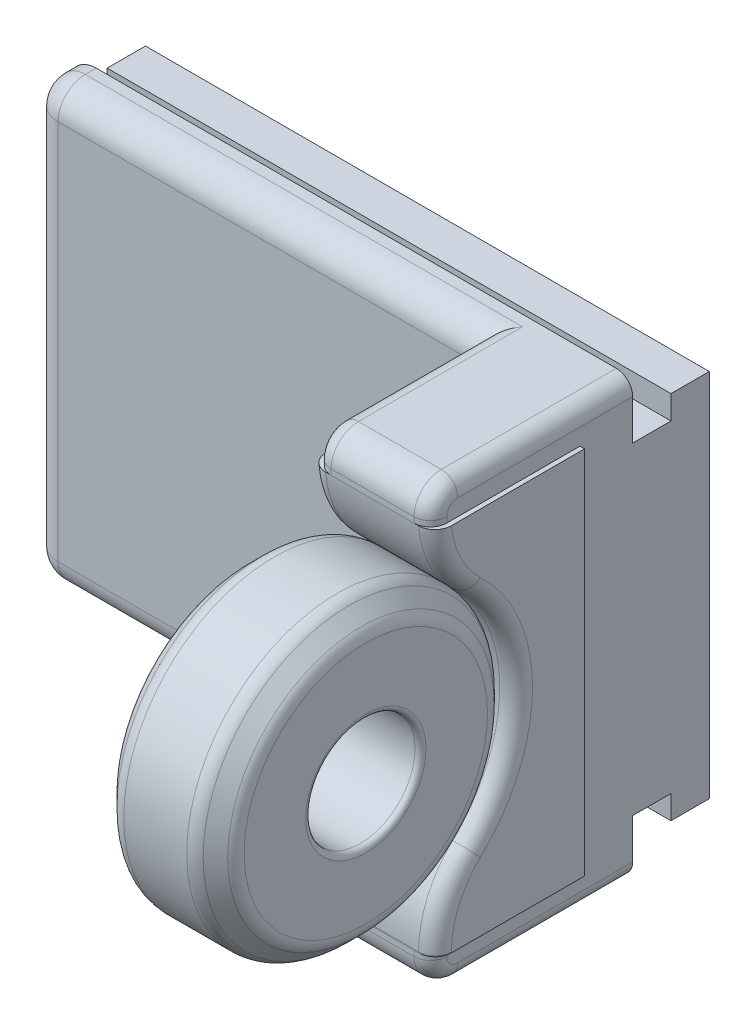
ISO-10303-21;
HEADER;
FILE_DESCRIPTION(('STEP AP214'),'2;1');
FILE_NAME('part.step','',(''),(''),'','','');
FILE_SCHEMA(('AUTOMOTIVE_DESIGN { 1 0 10303 214 1 1 1 1 }'));
ENDSEC;
DATA;
#1=APPLICATION_CONTEXT('core data for automotive mechanical design processes');
#2=APPLICATION_PROTOCOL_DEFINITION('international standard','automotive_design',2000,#1);
#3=PRODUCT_CONTEXT('',#1,'mechanical');
#4=PRODUCT('Part','Part','',(#3));
#5=PRODUCT_RELATED_PRODUCT_CATEGORY('part','',(#4));
#6=PRODUCT_DEFINITION_FORMATION('','',#4);
#7=PRODUCT_DEFINITION_CONTEXT('part definition',#1,'design');
#8=PRODUCT_DEFINITION('design','',#6,#7);
#9=PRODUCT_DEFINITION_SHAPE('','',#8);
#10=(LENGTH_UNIT() NAMED_UNIT(*) SI_UNIT(.MILLI.,.METRE.));
#11=(NAMED_UNIT(*) PLANE_ANGLE_UNIT() SI_UNIT($,.RADIAN.));
#12=(NAMED_UNIT(*) SI_UNIT($,.STERADIAN.) SOLID_ANGLE_UNIT());
#13=UNCERTAINTY_MEASURE_WITH_UNIT(LENGTH_MEASURE(1.E-05),#10,'distance_accuracy_value','');
#14=(GEOMETRIC_REPRESENTATION_CONTEXT(3) GLOBAL_UNCERTAINTY_ASSIGNED_CONTEXT((#13)) GLOBAL_UNIT_ASSIGNED_CONTEXT((#10,
#11,#12)) REPRESENTATION_CONTEXT('',''));
#15=CARTESIAN_POINT('',(0.,0.,0.));
#16=DIRECTION('',(0.,0.,1.));
#17=DIRECTION('',(1.,0.,0.));
#18=AXIS2_PLACEMENT_3D('',#15,#16,#17);
#19=CARTESIAN_POINT('',(-312.049673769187,-31.6722435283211,63.6586602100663));
#20=DIRECTION('',(1.,0.,0.));
#21=DIRECTION('',(0.,0.,-1.));
#22=AXIS2_PLACEMENT_3D('',#19,#20,#21);
#23=CYLINDRICAL_SURFACE('',#22,27.5);
#24=CARTESIAN_POINT('',(-306.807033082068,-31.6722435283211,63.6586602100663));
#25=DIRECTION('',(-1.,0.,0.));
#26=DIRECTION('',(0.,0.,1.));
#27=AXIS2_PLACEMENT_3D('',#24,#25,#26);
#28=CIRCLE('',#27,27.5);
#29=CARTESIAN_POINT('',(-306.807033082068,-31.6722435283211,91.1586602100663));
#30=VERTEX_POINT('',#29);
#31=EDGE_CURVE('E80',#30,#30,#28,.F.);
#32=ORIENTED_EDGE('',*,*,#31,.T.);
#33=EDGE_LOOP('',(#32));
#34=FACE_BOUND('',#33,.T.);
#35=CARTESIAN_POINT('',(-295.292314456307,-31.6722435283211,63.6586602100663));
#36=DIRECTION('',(1.,0.,0.));
#37=DIRECTION('',(0.,0.,-1.));
#38=AXIS2_PLACEMENT_3D('',#35,#36,#37);
#39=CIRCLE('',#38,27.5);
#40=CARTESIAN_POINT('',(-295.292314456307,-31.6722435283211,36.1586602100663));
#41=VERTEX_POINT('',#40);
#42=EDGE_CURVE('E83',#41,#41,#39,.F.);
#43=ORIENTED_EDGE('',*,*,#42,.T.);
#44=EDGE_LOOP('',(#43));
#45=FACE_BOUND('',#44,.T.);
#46=ADVANCED_FACE('F51',(#34,#45),#23,.T.);
#47=CARTESIAN_POINT('',(-312.049673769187,-31.6722435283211,63.6586602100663));
#48=DIRECTION('',(1.,0.,0.));
#49=DIRECTION('',(0.,0.,-1.));
#50=AXIS2_PLACEMENT_3D('',#47,#48,#49);
#51=PLANE('',#50);
#52=CARTESIAN_POINT('',(-312.049673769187,-31.6722435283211,63.6586602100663));
#53=DIRECTION('',(1.,0.,0.));
#54=DIRECTION('',(0.,0.,-1.));
#55=AXIS2_PLACEMENT_3D('',#52,#53,#54);
#56=CIRCLE('',#55,11.);
#57=CARTESIAN_POINT('',(-312.049673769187,-31.6722435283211,52.6586602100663));
#58=VERTEX_POINT('',#57);
#59=EDGE_CURVE('E66',#58,#58,#56,.T.);
#60=ORIENTED_EDGE('',*,*,#59,.T.);
#61=EDGE_LOOP('',(#60));
#62=FACE_BOUND('',#61,.T.);
#63=CARTESIAN_POINT('',(-312.049673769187,-31.6722435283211,63.6586602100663));
#64=DIRECTION('',(1.,0.,0.));
#65=DIRECTION('',(0.,0.,-1.));
#66=AXIS2_PLACEMENT_3D('',#63,#64,#65);
#67=CIRCLE('',#66,22.2573593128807);
#68=CARTESIAN_POINT('',(-312.049673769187,-31.6722435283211,41.4013008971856));
#69=VERTEX_POINT('',#68);
#70=EDGE_CURVE('E92',#69,#69,#67,.F.);
#71=ORIENTED_EDGE('',*,*,#70,.T.);
#72=EDGE_LOOP('',(#71));
#73=FACE_BOUND('',#72,.T.);
#74=ADVANCED_FACE('F96',(#62,#73),#51,.F.);
#75=CARTESIAN_POINT('',(-290.049673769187,-31.6722435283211,63.6586602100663));
#76=DIRECTION('',(1.,0.,0.));
#77=DIRECTION('',(0.,0.,-1.));
#78=AXIS2_PLACEMENT_3D('',#75,#76,#77);
#79=PLANE('',#78);
#80=CARTESIAN_POINT('',(-290.049673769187,-31.6722435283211,63.6586602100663));
#81=DIRECTION('',(1.,0.,0.));
#82=DIRECTION('',(0.,0.,-1.));
#83=AXIS2_PLACEMENT_3D('',#80,#81,#82);
#84=CIRCLE('',#83,11.);
#85=CARTESIAN_POINT('',(-290.049673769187,-31.6722435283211,52.6586602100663));
#86=VERTEX_POINT('',#85);
#87=EDGE_CURVE('E11',#86,#86,#84,.F.);
#88=ORIENTED_EDGE('',*,*,#87,.T.);
#89=EDGE_LOOP('',(#88));
#90=FACE_BOUND('',#89,.T.);
#91=CARTESIAN_POINT('',(-290.049673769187,-31.6722435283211,63.6586602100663));
#92=DIRECTION('',(1.,0.,0.));
#93=DIRECTION('',(0.,0.,-1.));
#94=AXIS2_PLACEMENT_3D('',#91,#92,#93);
#95=CIRCLE('',#94,22.2573593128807);
#96=CARTESIAN_POINT('',(-290.049673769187,-31.6722435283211,41.4013008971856));
#97=VERTEX_POINT('',#96);
#98=EDGE_CURVE('E71',#97,#97,#95,.T.);
#99=ORIENTED_EDGE('',*,*,#98,.T.);
#100=EDGE_LOOP('',(#99));
#101=FACE_BOUND('',#100,.T.);
#102=ADVANCED_FACE('F121',(#90,#101),#79,.T.);
#103=CARTESIAN_POINT('',(-312.049673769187,-31.6722435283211,63.6586602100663));
#104=DIRECTION('',(1.,0.,0.));
#105=DIRECTION('',(0.,0.,-1.));
#106=AXIS2_PLACEMENT_3D('',#103,#104,#105);
#107=CYLINDRICAL_SURFACE('',#106,10.);
#108=CARTESIAN_POINT('',(-311.049673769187,-31.6722435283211,63.6586602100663));
#109=DIRECTION('',(1.,0.,0.));
#110=DIRECTION('',(0.,0.,-1.));
#111=AXIS2_PLACEMENT_3D('',#108,#109,#110);
#112=CIRCLE('',#111,10.);
#113=CARTESIAN_POINT('',(-311.049673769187,-31.6722435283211,53.6586602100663));
#114=VERTEX_POINT('',#113);
#115=EDGE_CURVE('E58',#114,#114,#112,.F.);
#116=ORIENTED_EDGE('',*,*,#115,.T.);
#117=EDGE_LOOP('',(#116));
#118=FACE_BOUND('',#117,.T.);
#119=CARTESIAN_POINT('',(-291.049673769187,-31.6722435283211,63.6586602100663));
#120=DIRECTION('',(1.,0.,0.));
#121=DIRECTION('',(0.,0.,-1.));
#122=AXIS2_PLACEMENT_3D('',#119,#120,#121);
#123=CIRCLE('',#122,10.);
#124=CARTESIAN_POINT('',(-291.049673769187,-31.6722435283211,53.6586602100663));
#125=VERTEX_POINT('',#124);
#126=EDGE_CURVE('E62',#125,#125,#123,.T.);
#127=ORIENTED_EDGE('',*,*,#126,.T.);
#128=EDGE_LOOP('',(#127));
#129=FACE_BOUND('',#128,.T.);
#130=ADVANCED_FACE('F128',(#118,#129),#107,.F.);
#131=CARTESIAN_POINT('',(-308.049673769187,-31.6722435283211,63.6586602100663));
#132=DIRECTION('',(1.,0.,0.));
#133=DIRECTION('',(0.,0.,-1.));
#134=AXIS2_PLACEMENT_3D('',#131,#132,#133);
#135=CONICAL_SURFACE('',#134,27.5,0.785398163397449);
#136=CARTESIAN_POINT('',(-311.170994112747,-31.6722435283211,63.6586602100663));
#137=DIRECTION('',(1.,0.,0.));
#138=DIRECTION('',(0.,0.,-1.));
#139=AXIS2_PLACEMENT_3D('',#136,#137,#138);
#140=CIRCLE('',#139,24.3786796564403);
#141=CARTESIAN_POINT('',(-311.170994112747,-31.6722435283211,39.279980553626));
#142=VERTEX_POINT('',#141);
#143=EDGE_CURVE('E86',#142,#142,#140,.T.);
#144=ORIENTED_EDGE('',*,*,#143,.T.);
#145=EDGE_LOOP('',(#144));
#146=FACE_BOUND('',#145,.T.);
#147=CARTESIAN_POINT('',(-308.928353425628,-31.6722435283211,63.6586602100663));
#148=DIRECTION('',(-1.,0.,0.));
#149=DIRECTION('',(0.,0.,1.));
#150=AXIS2_PLACEMENT_3D('',#147,#148,#149);
#151=CIRCLE('',#150,26.6213203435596);
#152=CARTESIAN_POINT('',(-308.928353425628,-31.6722435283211,90.279980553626));
#153=VERTEX_POINT('',#152);
#154=EDGE_CURVE('E89',#153,#153,#151,.T.);
#155=ORIENTED_EDGE('',*,*,#154,.T.);
#156=EDGE_LOOP('',(#155));
#157=FACE_BOUND('',#156,.T.);
#158=ADVANCED_FACE('F111',(#146,#157),#135,.T.);
#159=CARTESIAN_POINT('',(-290.049673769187,-31.6722435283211,63.6586602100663));
#160=DIRECTION('',(-1.,0.,0.));
#161=DIRECTION('',(0.,0.,1.));
#162=AXIS2_PLACEMENT_3D('',#159,#160,#161);
#163=CONICAL_SURFACE('',#162,23.5,0.785398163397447);
#164=CARTESIAN_POINT('',(-293.170994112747,-31.6722435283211,63.6586602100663));
#165=DIRECTION('',(1.,0.,0.));
#166=DIRECTION('',(0.,0.,-1.));
#167=AXIS2_PLACEMENT_3D('',#164,#165,#166);
#168=CIRCLE('',#167,26.6213203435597);
#169=CARTESIAN_POINT('',(-293.170994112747,-31.6722435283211,37.0373398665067));
#170=VERTEX_POINT('',#169);
#171=EDGE_CURVE('E74',#170,#170,#168,.T.);
#172=ORIENTED_EDGE('',*,*,#171,.T.);
#173=EDGE_LOOP('',(#172));
#174=FACE_BOUND('',#173,.T.);
#175=CARTESIAN_POINT('',(-290.928353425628,-31.6722435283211,63.6586602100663));
#176=DIRECTION('',(1.,0.,0.));
#177=DIRECTION('',(0.,0.,-1.));
#178=AXIS2_PLACEMENT_3D('',#175,#176,#177);
#179=CIRCLE('',#178,24.3786796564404);
#180=CARTESIAN_POINT('',(-290.928353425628,-31.6722435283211,39.279980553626));
#181=VERTEX_POINT('',#180);
#182=EDGE_CURVE('E77',#181,#181,#179,.F.);
#183=ORIENTED_EDGE('',*,*,#182,.T.);
#184=EDGE_LOOP('',(#183));
#185=FACE_BOUND('',#184,.T.);
#186=ADVANCED_FACE('F101',(#174,#185),#163,.T.);
#187=CARTESIAN_POINT('',(-309.049673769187,-31.6722435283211,63.6586602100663));
#188=DIRECTION('',(1.,0.,0.));
#189=DIRECTION('',(0.,0.,-1.));
#190=AXIS2_PLACEMENT_3D('',#187,#188,#189);
#191=TOROIDAL_SURFACE('',#190,22.2573593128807,3.);
#192=ORIENTED_EDGE('',*,*,#143,.F.);
#193=EDGE_LOOP('',(#192));
#194=FACE_BOUND('',#193,.T.);
#195=ORIENTED_EDGE('',*,*,#70,.F.);
#196=EDGE_LOOP('',(#195));
#197=FACE_BOUND('',#196,.T.);
#198=ADVANCED_FACE('F98',(#194,#197),#191,.T.);
#199=CARTESIAN_POINT('',(-306.807033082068,-31.6722435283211,63.6586602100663));
#200=DIRECTION('',(-1.,0.,0.));
#201=DIRECTION('',(0.,0.,1.));
#202=AXIS2_PLACEMENT_3D('',#199,#200,#201);
#203=TOROIDAL_SURFACE('',#202,24.5,3.);
#204=ORIENTED_EDGE('',*,*,#154,.F.);
#205=EDGE_LOOP('',(#204));
#206=FACE_BOUND('',#205,.T.);
#207=ORIENTED_EDGE('',*,*,#31,.F.);
#208=EDGE_LOOP('',(#207));
#209=FACE_BOUND('',#208,.T.);
#210=ADVANCED_FACE('F100',(#206,#209),#203,.T.);
#211=CARTESIAN_POINT('',(-295.292314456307,-31.6722435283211,63.6586602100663));
#212=DIRECTION('',(1.,0.,0.));
#213=DIRECTION('',(0.,0.,-1.));
#214=AXIS2_PLACEMENT_3D('',#211,#212,#213);
#215=TOROIDAL_SURFACE('',#214,24.5,3.);
#216=ORIENTED_EDGE('',*,*,#171,.F.);
#217=EDGE_LOOP('',(#216));
#218=FACE_BOUND('',#217,.T.);
#219=ORIENTED_EDGE('',*,*,#42,.F.);
#220=EDGE_LOOP('',(#219));
#221=FACE_BOUND('',#220,.T.);
#222=ADVANCED_FACE('F108',(#218,#221),#215,.T.);
#223=CARTESIAN_POINT('',(-293.049673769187,-31.6722435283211,63.6586602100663));
#224=DIRECTION('',(1.,0.,0.));
#225=DIRECTION('',(0.,0.,-1.));
#226=AXIS2_PLACEMENT_3D('',#223,#224,#225);
#227=TOROIDAL_SURFACE('',#226,22.2573593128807,3.);
#228=ORIENTED_EDGE('',*,*,#182,.F.);
#229=EDGE_LOOP('',(#228));
#230=FACE_BOUND('',#229,.T.);
#231=ORIENTED_EDGE('',*,*,#98,.F.);
#232=EDGE_LOOP('',(#231));
#233=FACE_BOUND('',#232,.T.);
#234=ADVANCED_FACE('F150',(#230,#233),#227,.T.);
#235=CARTESIAN_POINT('',(-311.049673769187,-31.6722435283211,63.6586602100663));
#236=DIRECTION('',(1.,0.,0.));
#237=DIRECTION('',(0.,0.,-1.));
#238=AXIS2_PLACEMENT_3D('',#235,#236,#237);
#239=TOROIDAL_SURFACE('',#238,11.,1.);
#240=ORIENTED_EDGE('',*,*,#115,.F.);
#241=EDGE_LOOP('',(#240));
#242=FACE_BOUND('',#241,.T.);
#243=ORIENTED_EDGE('',*,*,#59,.F.);
#244=EDGE_LOOP('',(#243));
#245=FACE_BOUND('',#244,.T.);
#246=ADVANCED_FACE('F145',(#242,#245),#239,.T.);
#247=CARTESIAN_POINT('',(-291.049673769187,-31.6722435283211,63.6586602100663));
#248=DIRECTION('',(1.,0.,0.));
#249=DIRECTION('',(0.,0.,-1.));
#250=AXIS2_PLACEMENT_3D('',#247,#248,#249);
#251=TOROIDAL_SURFACE('',#250,11.,1.);
#252=ORIENTED_EDGE('',*,*,#87,.F.);
#253=EDGE_LOOP('',(#252));
#254=FACE_BOUND('',#253,.T.);
#255=ORIENTED_EDGE('',*,*,#126,.F.);
#256=EDGE_LOOP('',(#255));
#257=FACE_BOUND('',#256,.T.);
#258=ADVANCED_FACE('F53',(#254,#257),#251,.T.);
#259=CLOSED_SHELL('',(#46,#74,#102,#130,#158,#186,#198,#210,#222,#234,#246,#258));
#260=MANIFOLD_SOLID_BREP('B2',#259);
#261=CARTESIAN_POINT('',(-313.049673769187,-31.6722435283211,63.6586602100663));
#262=DIRECTION('',(1.,0.,0.));
#263=DIRECTION('',(0.,0.,-1.));
#264=AXIS2_PLACEMENT_3D('',#261,#262,#263);
#265=CYLINDRICAL_SURFACE('',#264,27.5);
#266=DIRECTION('',(1.,0.,0.));
#267=VECTOR('',#266,1.);
#268=CARTESIAN_POINT('',(-313.049673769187,-11.6707807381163,44.7856242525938));
#269=LINE('',#268,#267);
#270=CARTESIAN_POINT('',(-293.049673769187,-11.6707807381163,44.7856242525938));
#271=VERTEX_POINT('',#270);
#272=CARTESIAN_POINT('',(-310.049673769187,-11.6707807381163,44.7856242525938));
#273=VERTEX_POINT('',#272);
#274=EDGE_CURVE('E372',#271,#273,#269,.F.);
#275=ORIENTED_EDGE('',*,*,#274,.T.);
#276=CARTESIAN_POINT('',(-310.049673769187,-31.6722435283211,63.6586602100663));
#277=DIRECTION('',(-1.,0.,0.));
#278=DIRECTION('',(0.,0.,1.));
#279=AXIS2_PLACEMENT_3D('',#276,#277,#278);
#280=CIRCLE('',#279,27.5);
#281=CARTESIAN_POINT('',(-310.049673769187,-51.6409927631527,44.7510148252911));
#282=VERTEX_POINT('',#281);
#283=EDGE_CURVE('E49',#273,#282,#280,.T.);
#284=ORIENTED_EDGE('',*,*,#283,.T.);
#285=DIRECTION('',(1.,0.,0.));
#286=VECTOR('',#285,1.);
#287=CARTESIAN_POINT('',(-313.049673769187,-51.6409927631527,44.7510148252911));
#288=LINE('',#287,#286);
#289=CARTESIAN_POINT('',(-293.049673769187,-51.6409927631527,44.7510148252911));
#290=VERTEX_POINT('',#289);
#291=EDGE_CURVE('E375',#282,#290,#288,.T.);
#292=ORIENTED_EDGE('',*,*,#291,.T.);
#293=CARTESIAN_POINT('',(-293.049673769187,-31.6722435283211,63.6586602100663));
#294=DIRECTION('',(-1.,0.,0.));
#295=DIRECTION('',(0.,0.,1.));
#296=AXIS2_PLACEMENT_3D('',#293,#294,#295);
#297=CIRCLE('',#296,27.5);
#298=EDGE_CURVE('E252',#290,#271,#297,.F.);
#299=ORIENTED_EDGE('',*,*,#298,.T.);
#300=EDGE_LOOP('',(#275,#284,#292,#299));
#301=FACE_BOUND('',#300,.T.);
#302=ADVANCED_FACE('F243',(#301),#265,.F.);
#303=CARTESIAN_POINT('',(-313.049673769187,1.33054408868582,0.));
#304=DIRECTION('',(0.,-1.,0.));
#305=DIRECTION('',(0.,0.,-1.));
#306=AXIS2_PLACEMENT_3D('',#303,#304,#305);
#307=PLANE('',#306);
#308=DIRECTION('',(0.,0.,-1.));
#309=VECTOR('',#308,1.);
#310=CARTESIAN_POINT('',(-313.049673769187,1.33054408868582,0.));
#311=LINE('',#310,#309);
#312=CARTESIAN_POINT('',(-313.049673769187,1.33054408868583,47.9894100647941));
#313=VERTEX_POINT('',#312);
#314=CARTESIAN_POINT('',(-313.049673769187,1.33054408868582,23.6586602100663));
#315=VERTEX_POINT('',#314);
#316=EDGE_CURVE('E359',#313,#315,#311,.T.);
#317=ORIENTED_EDGE('',*,*,#316,.F.);
#318=CARTESIAN_POINT('',(-313.049673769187,1.33054408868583,47.9894100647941));
#319=CARTESIAN_POINT('',(-313.049681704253,1.33054408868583,48.074325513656));
#320=CARTESIAN_POINT('',(-313.046098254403,1.33054408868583,48.1592374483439));
#321=CARTESIAN_POINT('',(-313.031807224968,1.33054408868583,48.3284568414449));
#322=CARTESIAN_POINT('',(-313.021099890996,1.33054408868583,48.4127643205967));
#323=CARTESIAN_POINT('',(-312.992628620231,1.33054408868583,48.5801310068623));
#324=CARTESIAN_POINT('',(-312.97486909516,1.33054408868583,48.6631909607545));
#325=CARTESIAN_POINT('',(-312.9324326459,1.33054408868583,48.8274992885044));
#326=CARTESIAN_POINT('',(-312.907755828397,1.33054408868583,48.9087476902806));
#327=CARTESIAN_POINT('',(-312.823536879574,1.33054408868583,49.1490007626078));
#328=CARTESIAN_POINT('',(-312.753796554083,1.33054408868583,49.3045700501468));
#329=CARTESIAN_POINT('',(-312.589177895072,1.33054408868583,49.6016352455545));
#330=CARTESIAN_POINT('',(-312.494305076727,1.33054408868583,49.7431342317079));
#331=CARTESIAN_POINT('',(-312.282297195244,1.33054408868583,50.0078400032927));
#332=CARTESIAN_POINT('',(-312.165212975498,1.33054408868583,50.1310874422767));
#333=CARTESIAN_POINT('',(-311.911925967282,1.33054408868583,50.3561144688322));
#334=CARTESIAN_POINT('',(-311.775719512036,1.33054408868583,50.4578899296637));
#335=CARTESIAN_POINT('',(-311.488558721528,1.33054408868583,50.6367145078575));
#336=CARTESIAN_POINT('',(-311.337652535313,1.33054408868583,50.7138410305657));
#337=CARTESIAN_POINT('',(-311.025042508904,1.33054408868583,50.8415459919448));
#338=CARTESIAN_POINT('',(-310.863345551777,1.33054408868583,50.892141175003));
#339=CARTESIAN_POINT('',(-310.592117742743,1.33054408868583,50.9524305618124));
#340=CARTESIAN_POINT('',(-310.48432560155,1.33054408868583,50.9702585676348));
#341=CARTESIAN_POINT('',(-310.267595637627,1.33054408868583,50.9940413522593));
#342=CARTESIAN_POINT('',(-310.158659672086,1.33054408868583,51.0000130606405));
#343=CARTESIAN_POINT('',(-310.049673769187,1.33054408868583,51.));
#344=B_SPLINE_CURVE_WITH_KNOTS('',3,(#318,#319,#320,#321,#322,#323,#324,#325,#326,#327,#328,
#329,#330,#331,#332,#333,#334,#335,#336,#337,#338,#339,#340,#341,#342,#343),.UNSPECIFIED.,.F.,
.F.,(4,2,2,2,2,2,2,2,2,2,2,2,4),(0.,0.254664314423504,0.509319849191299,0.763816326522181,
1.01830887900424,1.52712344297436,2.03582644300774,2.54337873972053,3.05102849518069,
3.55706804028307,4.06278782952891,4.38995223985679,4.71664915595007),.UNSPECIFIED.);
#345=CARTESIAN_POINT('',(-310.049673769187,1.33054408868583,51.));
#346=VERTEX_POINT('',#345);
#347=EDGE_CURVE('E396',#313,#346,#344,.T.);
#348=ORIENTED_EDGE('',*,*,#347,.T.);
#349=DIRECTION('',(1.,0.,0.));
#350=VECTOR('',#349,1.);
#351=CARTESIAN_POINT('',(-313.049673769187,1.33054408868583,51.));
#352=LINE('',#351,#350);
#353=CARTESIAN_POINT('',(-293.049673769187,1.33054408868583,51.));
#354=VERTEX_POINT('',#353);
#355=EDGE_CURVE('E351',#346,#354,#352,.T.);
#356=ORIENTED_EDGE('',*,*,#355,.T.);
#357=CARTESIAN_POINT('',(-293.049673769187,1.33054408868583,51.));
#358=CARTESIAN_POINT('',(-292.965485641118,1.33054408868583,51.000008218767));
#359=CARTESIAN_POINT('',(-292.88130141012,1.33054408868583,50.9964455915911));
#360=CARTESIAN_POINT('',(-292.713536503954,1.33054408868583,50.9822422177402));
#361=CARTESIAN_POINT('',(-292.629955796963,1.33054408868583,50.9716018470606));
#362=CARTESIAN_POINT('',(-292.464053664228,1.33054408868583,50.9433183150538));
#363=CARTESIAN_POINT('',(-292.381731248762,1.33054408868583,50.9256809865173));
#364=CARTESIAN_POINT('',(-292.218885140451,1.33054408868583,50.8835485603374));
#365=CARTESIAN_POINT('',(-292.138361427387,1.33054408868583,50.8590535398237));
#366=CARTESIAN_POINT('',(-291.900268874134,1.33054408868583,50.7754850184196));
#367=CARTESIAN_POINT('',(-291.746106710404,1.33054408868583,50.7063157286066));
#368=CARTESIAN_POINT('',(-291.451675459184,1.33054408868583,50.5431519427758));
#369=CARTESIAN_POINT('',(-291.311404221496,1.33054408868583,50.4491612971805));
#370=CARTESIAN_POINT('',(-291.048402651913,1.33054408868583,50.2388880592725));
#371=CARTESIAN_POINT('',(-290.92569330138,1.33054408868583,50.1225791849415));
#372=CARTESIAN_POINT('',(-290.701458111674,1.33054408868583,49.871040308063));
#373=CARTESIAN_POINT('',(-290.599936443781,1.33054408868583,49.7358065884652));
#374=CARTESIAN_POINT('',(-290.420646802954,1.33054408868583,49.4498529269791));
#375=CARTESIAN_POINT('',(-290.342952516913,1.33054408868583,49.2990868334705));
#376=CARTESIAN_POINT('',(-290.213917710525,1.33054408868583,48.9867078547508));
#377=CARTESIAN_POINT('',(-290.162563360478,1.33054408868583,48.8251007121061));
#378=CARTESIAN_POINT('',(-290.100010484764,1.33054408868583,48.5503740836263));
#379=CARTESIAN_POINT('',(-290.081143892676,1.33054408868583,48.4389389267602));
#380=CARTESIAN_POINT('',(-290.055976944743,1.33054408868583,48.2148207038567));
#381=CARTESIAN_POINT('',(-290.049658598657,1.33054408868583,48.1021396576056));
#382=CARTESIAN_POINT('',(-290.049673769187,1.33054408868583,47.9894100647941));
#383=B_SPLINE_CURVE_WITH_KNOTS('',3,(#357,#358,#359,#360,#361,#362,#363,#364,#365,#366,#367,
#368,#369,#370,#371,#372,#373,#374,#375,#376,#377,#378,#379,#380,#381,#382),.UNSPECIFIED.,.F.,
.F.,(4,2,2,2,2,2,2,2,2,2,2,2,4),(0.,0.252482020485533,0.504950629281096,0.757209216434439,
1.00946496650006,1.51376034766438,2.01797754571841,2.5227921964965,3.02770613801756,
3.53416615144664,4.04035997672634,4.37876250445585,4.71667951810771),.UNSPECIFIED.);
#384=CARTESIAN_POINT('',(-290.049673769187,1.33054408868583,47.9894100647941));
#385=VERTEX_POINT('',#384);
#386=EDGE_CURVE('E340',#354,#385,#383,.T.);
#387=ORIENTED_EDGE('',*,*,#386,.T.);
#388=DIRECTION('',(0.,0.,-1.));
#389=VECTOR('',#388,1.);
#390=CARTESIAN_POINT('',(-290.049673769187,1.33054408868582,0.));
#391=LINE('',#390,#389);
#392=CARTESIAN_POINT('',(-290.049673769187,1.33054408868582,23.6586602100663));
#393=VERTEX_POINT('',#392);
#394=EDGE_CURVE('E332',#385,#393,#391,.T.);
#395=ORIENTED_EDGE('',*,*,#394,.T.);
#396=DIRECTION('',(1.,0.,0.));
#397=VECTOR('',#396,1.);
#398=CARTESIAN_POINT('',(-313.049673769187,1.33054408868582,23.6586602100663));
#399=LINE('',#398,#397);
#400=EDGE_CURVE('E336',#315,#393,#399,.T.);
#401=ORIENTED_EDGE('',*,*,#400,.F.);
#402=EDGE_LOOP('',(#317,#348,#356,#387,#395,#401));
#403=FACE_BOUND('',#402,.T.);
#404=ADVANCED_FACE('F335',(#403),#307,.F.);
#405=CARTESIAN_POINT('',(-313.049673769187,0.,23.6586602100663));
#406=DIRECTION('',(0.,0.,1.));
#407=DIRECTION('',(0.,-1.,0.));
#408=AXIS2_PLACEMENT_3D('',#405,#406,#407);
#409=PLANE('',#408);
#410=ORIENTED_EDGE('',*,*,#400,.T.);
#411=DIRECTION('',(0.,-1.,0.));
#412=VECTOR('',#411,1.);
#413=CARTESIAN_POINT('',(-290.049673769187,0.,23.6586602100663));
#414=LINE('',#413,#412);
#415=CARTESIAN_POINT('',(-290.049673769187,-66.3305440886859,23.6586602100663));
#416=VERTEX_POINT('',#415);
#417=EDGE_CURVE('E343',#393,#416,#414,.T.);
#418=ORIENTED_EDGE('',*,*,#417,.T.);
#419=DIRECTION('',(1.,0.,0.));
#420=VECTOR('',#419,1.);
#421=CARTESIAN_POINT('',(-313.049673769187,-66.3305440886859,23.6586602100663));
#422=LINE('',#421,#420);
#423=CARTESIAN_POINT('',(-313.049673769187,-66.3305440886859,23.6586602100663));
#424=VERTEX_POINT('',#423);
#425=EDGE_CURVE('E352',#424,#416,#422,.T.);
#426=ORIENTED_EDGE('',*,*,#425,.F.);
#427=DIRECTION('',(0.,-1.,0.));
#428=VECTOR('',#427,1.);
#429=CARTESIAN_POINT('',(-313.049673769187,0.,23.6586602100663));
#430=LINE('',#429,#428);
#431=EDGE_CURVE('E350',#315,#424,#430,.T.);
#432=ORIENTED_EDGE('',*,*,#431,.F.);
#433=EDGE_LOOP('',(#410,#418,#426,#432));
#434=FACE_BOUND('',#433,.T.);
#435=ADVANCED_FACE('F348',(#434),#409,.F.);
#436=CARTESIAN_POINT('',(-313.049673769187,-66.3305440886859,0.));
#437=DIRECTION('',(0.,1.,0.));
#438=DIRECTION('',(0.,0.,1.));
#439=AXIS2_PLACEMENT_3D('',#436,#437,#438);
#440=PLANE('',#439);
#441=DIRECTION('',(1.,0.,0.));
#442=VECTOR('',#441,1.);
#443=CARTESIAN_POINT('',(-313.049673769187,-66.3305440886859,51.));
#444=LINE('',#443,#442);
#445=CARTESIAN_POINT('',(-310.049673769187,-66.3305440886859,51.));
#446=VERTEX_POINT('',#445);
#447=CARTESIAN_POINT('',(-293.049673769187,-66.3305440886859,51.));
#448=VERTEX_POINT('',#447);
#449=EDGE_CURVE('E367',#446,#448,#444,.T.);
#450=ORIENTED_EDGE('',*,*,#449,.F.);
#451=CARTESIAN_POINT('',(-310.049673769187,-66.3305440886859,48.));
#452=DIRECTION('',(0.,1.,0.));
#453=DIRECTION('',(0.,0.,1.));
#454=AXIS2_PLACEMENT_3D('',#451,#452,#453);
#455=CIRCLE('',#454,3.);
#456=CARTESIAN_POINT('',(-313.049673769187,-66.3305440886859,48.));
#457=VERTEX_POINT('',#456);
#458=EDGE_CURVE('E442',#446,#457,#455,.F.);
#459=ORIENTED_EDGE('',*,*,#458,.T.);
#460=DIRECTION('',(0.,0.,1.));
#461=VECTOR('',#460,1.);
#462=CARTESIAN_POINT('',(-313.049673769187,-66.3305440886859,0.));
#463=LINE('',#462,#461);
#464=EDGE_CURVE('E364',#424,#457,#463,.T.);
#465=ORIENTED_EDGE('',*,*,#464,.F.);
#466=ORIENTED_EDGE('',*,*,#425,.T.);
#467=DIRECTION('',(0.,0.,1.));
#468=VECTOR('',#467,1.);
#469=CARTESIAN_POINT('',(-290.049673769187,-66.3305440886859,0.));
#470=LINE('',#469,#468);
#471=CARTESIAN_POINT('',(-290.049673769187,-66.3305440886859,48.));
#472=VERTEX_POINT('',#471);
#473=EDGE_CURVE('E357',#416,#472,#470,.T.);
#474=ORIENTED_EDGE('',*,*,#473,.T.);
#475=CARTESIAN_POINT('',(-293.049673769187,-66.3305440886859,48.));
#476=DIRECTION('',(0.,1.,0.));
#477=DIRECTION('',(0.,0.,1.));
#478=AXIS2_PLACEMENT_3D('',#475,#476,#477);
#479=CIRCLE('',#478,3.);
#480=EDGE_CURVE('E450',#472,#448,#479,.F.);
#481=ORIENTED_EDGE('',*,*,#480,.T.);
#482=EDGE_LOOP('',(#450,#459,#465,#466,#474,#481));
#483=FACE_BOUND('',#482,.T.);
#484=ADVANCED_FACE('F487',(#483),#440,.F.);
#485=CARTESIAN_POINT('',(-313.049673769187,0.,51.));
#486=DIRECTION('',(0.,0.,-1.));
#487=DIRECTION('',(-1.,0.,0.));
#488=AXIS2_PLACEMENT_3D('',#485,#486,#487);
#489=PLANE('',#488);
#490=DIRECTION('',(-1.,0.,0.));
#491=VECTOR('',#490,1.);
#492=CARTESIAN_POINT('',(-313.049673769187,-66.1637194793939,51.));
#493=LINE('',#492,#491);
#494=CARTESIAN_POINT('',(-293.049673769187,-66.1637194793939,51.));
#495=VERTEX_POINT('',#494);
#496=CARTESIAN_POINT('',(-310.049673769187,-66.1637194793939,51.));
#497=VERTEX_POINT('',#496);
#498=EDGE_CURVE('E378',#495,#497,#493,.T.);
#499=ORIENTED_EDGE('',*,*,#498,.T.);
#500=DIRECTION('',(0.,1.,0.));
#501=VECTOR('',#500,1.);
#502=CARTESIAN_POINT('',(-310.049673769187,-66.3305440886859,51.));
#503=LINE('',#502,#501);
#504=EDGE_CURVE('E444',#497,#446,#503,.F.);
#505=ORIENTED_EDGE('',*,*,#504,.T.);
#506=ORIENTED_EDGE('',*,*,#449,.T.);
#507=DIRECTION('',(0.,1.,0.));
#508=VECTOR('',#507,1.);
#509=CARTESIAN_POINT('',(-293.049673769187,0.,51.));
#510=LINE('',#509,#508);
#511=EDGE_CURVE('E486',#448,#495,#510,.T.);
#512=ORIENTED_EDGE('',*,*,#511,.T.);
#513=EDGE_LOOP('',(#499,#505,#506,#512));
#514=FACE_BOUND('',#513,.T.);
#515=ADVANCED_FACE('F501',(#514),#489,.F.);
#516=CARTESIAN_POINT('',(-313.049673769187,0.,0.));
#517=DIRECTION('',(-1.,0.,0.));
#518=DIRECTION('',(0.,0.,1.));
#519=AXIS2_PLACEMENT_3D('',#516,#517,#518);
#520=PLANE('',#519);
#521=CARTESIAN_POINT('',(-313.049673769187,-31.6722435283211,63.6586602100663));
#522=DIRECTION('',(-1.,0.,0.));
#523=DIRECTION('',(0.,0.,1.));
#524=AXIS2_PLACEMENT_3D('',#521,#522,#523);
#525=CIRCLE('',#524,30.5);
#526=CARTESIAN_POINT('',(-313.049673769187,-53.8194017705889,42.6883626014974));
#527=VERTEX_POINT('',#526);
#528=CARTESIAN_POINT('',(-313.049673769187,-9.48880297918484,42.7267476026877));
#529=VERTEX_POINT('',#528);
#530=EDGE_CURVE('E381',#527,#529,#525,.F.);
#531=ORIENTED_EDGE('',*,*,#530,.T.);
#532=CARTESIAN_POINT('',(-313.049673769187,2.87573765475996,31.0597799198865));
#533=DIRECTION('',(-1.,0.,0.));
#534=DIRECTION('',(0.,0.,1.));
#535=AXIS2_PLACEMENT_3D('',#532,#533,#534);
#536=CIRCLE('',#535,17.);
#537=EDGE_CURVE('E387',#529,#313,#536,.T.);
#538=ORIENTED_EDGE('',*,*,#537,.T.);
#539=ORIENTED_EDGE('',*,*,#316,.T.);
#540=ORIENTED_EDGE('',*,*,#431,.T.);
#541=ORIENTED_EDGE('',*,*,#464,.T.);
#542=DIRECTION('',(0.,1.,0.));
#543=VECTOR('',#542,1.);
#544=CARTESIAN_POINT('',(-313.049673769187,-66.1637194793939,48.));
#545=LINE('',#544,#543);
#546=CARTESIAN_POINT('',(-313.049673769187,-66.1637194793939,48.));
#547=VERTEX_POINT('',#546);
#548=EDGE_CURVE('E385',#457,#547,#545,.T.);
#549=ORIENTED_EDGE('',*,*,#548,.T.);
#550=CARTESIAN_POINT('',(-313.049673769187,-66.1637194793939,31.));
#551=DIRECTION('',(-1.,0.,0.));
#552=DIRECTION('',(0.,0.,1.));
#553=AXIS2_PLACEMENT_3D('',#550,#551,#552);
#554=CIRCLE('',#553,17.);
#555=EDGE_CURVE('E383',#547,#527,#554,.T.);
#556=ORIENTED_EDGE('',*,*,#555,.T.);
#557=EDGE_LOOP('',(#531,#538,#539,#540,#541,#549,#556));
#558=FACE_BOUND('',#557,.T.);
#559=ADVANCED_FACE('F489',(#558),#520,.T.);
#560=CARTESIAN_POINT('',(-290.049673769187,0.,0.));
#561=DIRECTION('',(-1.,0.,0.));
#562=DIRECTION('',(0.,0.,1.));
#563=AXIS2_PLACEMENT_3D('',#560,#561,#562);
#564=PLANE('',#563);
#565=ORIENTED_EDGE('',*,*,#394,.F.);
#566=CARTESIAN_POINT('',(-290.049673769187,2.87573765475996,31.0597799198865));
#567=DIRECTION('',(-1.,0.,0.));
#568=DIRECTION('',(0.,0.,1.));
#569=AXIS2_PLACEMENT_3D('',#566,#567,#568);
#570=CIRCLE('',#569,17.);
#571=CARTESIAN_POINT('',(-290.049673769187,-9.48880297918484,42.7267476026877));
#572=VERTEX_POINT('',#571);
#573=EDGE_CURVE('E462',#385,#572,#570,.F.);
#574=ORIENTED_EDGE('',*,*,#573,.T.);
#575=CARTESIAN_POINT('',(-290.049673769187,-31.6722435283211,63.6586602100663));
#576=DIRECTION('',(-1.,0.,0.));
#577=DIRECTION('',(0.,0.,1.));
#578=AXIS2_PLACEMENT_3D('',#575,#576,#577);
#579=CIRCLE('',#578,30.5);
#580=CARTESIAN_POINT('',(-290.049673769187,-53.8194017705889,42.6883626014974));
#581=VERTEX_POINT('',#580);
#582=EDGE_CURVE('E265',#572,#581,#579,.T.);
#583=ORIENTED_EDGE('',*,*,#582,.T.);
#584=CARTESIAN_POINT('',(-290.049673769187,-66.1637194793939,31.));
#585=DIRECTION('',(-1.,0.,0.));
#586=DIRECTION('',(0.,0.,1.));
#587=AXIS2_PLACEMENT_3D('',#584,#585,#586);
#588=CIRCLE('',#587,17.);
#589=CARTESIAN_POINT('',(-290.049673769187,-66.1637194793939,48.));
#590=VERTEX_POINT('',#589);
#591=EDGE_CURVE('E260',#581,#590,#588,.F.);
#592=ORIENTED_EDGE('',*,*,#591,.T.);
#593=DIRECTION('',(0.,1.,0.));
#594=VECTOR('',#593,1.);
#595=CARTESIAN_POINT('',(-290.049673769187,0.,48.));
#596=LINE('',#595,#594);
#597=EDGE_CURVE('E460',#590,#472,#596,.F.);
#598=ORIENTED_EDGE('',*,*,#597,.T.);
#599=ORIENTED_EDGE('',*,*,#473,.F.);
#600=ORIENTED_EDGE('',*,*,#417,.F.);
#601=EDGE_LOOP('',(#565,#574,#583,#592,#598,#599,#600));
#602=FACE_BOUND('',#601,.T.);
#603=ADVANCED_FACE('F355',(#602),#564,.F.);
#604=CARTESIAN_POINT('',(-313.049673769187,-66.1637194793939,31.));
#605=DIRECTION('',(1.,0.,0.));
#606=DIRECTION('',(0.,0.,-1.));
#607=AXIS2_PLACEMENT_3D('',#604,#605,#606);
#608=CYLINDRICAL_SURFACE('',#607,20.);
#609=ORIENTED_EDGE('',*,*,#291,.F.);
#610=CARTESIAN_POINT('',(-310.049673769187,-66.1637194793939,31.));
#611=DIRECTION('',(-1.,0.,0.));
#612=DIRECTION('',(0.,0.,1.));
#613=AXIS2_PLACEMENT_3D('',#610,#611,#612);
#614=CIRCLE('',#613,20.);
#615=EDGE_CURVE('E452',#282,#497,#614,.F.);
#616=ORIENTED_EDGE('',*,*,#615,.T.);
#617=ORIENTED_EDGE('',*,*,#498,.F.);
#618=CARTESIAN_POINT('',(-293.049673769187,-66.1637194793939,31.));
#619=DIRECTION('',(-1.,0.,0.));
#620=DIRECTION('',(0.,0.,1.));
#621=AXIS2_PLACEMENT_3D('',#618,#619,#620);
#622=CIRCLE('',#621,20.);
#623=EDGE_CURVE('E449',#495,#290,#622,.T.);
#624=ORIENTED_EDGE('',*,*,#623,.T.);
#625=EDGE_LOOP('',(#609,#616,#617,#624));
#626=FACE_BOUND('',#625,.T.);
#627=ADVANCED_FACE('F415',(#626),#608,.T.);
#628=CARTESIAN_POINT('',(-313.049673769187,2.87573765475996,31.0597799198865));
#629=DIRECTION('',(1.,0.,0.));
#630=DIRECTION('',(0.,0.,-1.));
#631=AXIS2_PLACEMENT_3D('',#628,#629,#630);
#632=CYLINDRICAL_SURFACE('',#631,20.);
#633=ORIENTED_EDGE('',*,*,#355,.F.);
#634=CARTESIAN_POINT('',(-310.049673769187,2.87573765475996,31.0597799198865));
#635=DIRECTION('',(-1.,0.,0.));
#636=DIRECTION('',(0.,0.,1.));
#637=AXIS2_PLACEMENT_3D('',#634,#635,#636);
#638=CIRCLE('',#637,20.);
#639=EDGE_CURVE('E495',#346,#273,#638,.F.);
#640=ORIENTED_EDGE('',*,*,#639,.T.);
#641=ORIENTED_EDGE('',*,*,#274,.F.);
#642=CARTESIAN_POINT('',(-293.049673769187,2.87573765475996,31.0597799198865));
#643=DIRECTION('',(-1.,0.,0.));
#644=DIRECTION('',(0.,0.,1.));
#645=AXIS2_PLACEMENT_3D('',#642,#643,#644);
#646=CIRCLE('',#645,20.);
#647=EDGE_CURVE('E493',#271,#354,#646,.T.);
#648=ORIENTED_EDGE('',*,*,#647,.T.);
#649=EDGE_LOOP('',(#633,#640,#641,#648));
#650=FACE_BOUND('',#649,.T.);
#651=ADVANCED_FACE('F418',(#650),#632,.T.);
#652=CARTESIAN_POINT('',(-310.049673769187,0.,48.));
#653=DIRECTION('',(0.,-1.,0.));
#654=DIRECTION('',(0.,0.,-1.));
#655=AXIS2_PLACEMENT_3D('',#652,#653,#654);
#656=CYLINDRICAL_SURFACE('',#655,3.);
#657=ORIENTED_EDGE('',*,*,#458,.F.);
#658=ORIENTED_EDGE('',*,*,#504,.F.);
#659=CARTESIAN_POINT('',(-310.049673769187,-66.1637194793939,48.));
#660=DIRECTION('',(0.,1.,0.));
#661=DIRECTION('',(0.,0.,1.));
#662=AXIS2_PLACEMENT_3D('',#659,#660,#661);
#663=CIRCLE('',#662,3.);
#664=EDGE_CURVE('E344',#547,#497,#663,.T.);
#665=ORIENTED_EDGE('',*,*,#664,.F.);
#666=ORIENTED_EDGE('',*,*,#548,.F.);
#667=EDGE_LOOP('',(#657,#658,#665,#666));
#668=FACE_BOUND('',#667,.T.);
#669=ADVANCED_FACE('F421',(#668),#656,.T.);
#670=CARTESIAN_POINT('',(-310.049673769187,-66.1637194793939,31.));
#671=DIRECTION('',(-1.,0.,0.));
#672=DIRECTION('',(0.,0.,1.));
#673=AXIS2_PLACEMENT_3D('',#670,#671,#672);
#674=TOROIDAL_SURFACE('',#673,17.,3.);
#675=ORIENTED_EDGE('',*,*,#664,.T.);
#676=ORIENTED_EDGE('',*,*,#615,.F.);
#677=CARTESIAN_POINT('',(-310.049673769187,-53.8194017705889,42.6883626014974));
#678=DIRECTION('',(0.,0.687550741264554,-0.726136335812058));
#679=DIRECTION('',(0.,0.726136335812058,0.687550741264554));
#680=AXIS2_PLACEMENT_3D('',#677,#678,#679);
#681=CIRCLE('',#680,3.);
#682=EDGE_CURVE('E468',#527,#282,#681,.T.);
#683=ORIENTED_EDGE('',*,*,#682,.F.);
#684=ORIENTED_EDGE('',*,*,#555,.F.);
#685=EDGE_LOOP('',(#675,#676,#683,#684));
#686=FACE_BOUND('',#685,.T.);
#687=ADVANCED_FACE('F431',(#686),#674,.T.);
#688=CARTESIAN_POINT('',(-310.049673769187,-31.6722435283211,63.6586602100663));
#689=DIRECTION('',(-1.,0.,0.));
#690=DIRECTION('',(0.,0.,1.));
#691=AXIS2_PLACEMENT_3D('',#688,#689,#690);
#692=TOROIDAL_SURFACE('',#691,30.5,3.);
#693=ORIENTED_EDGE('',*,*,#682,.T.);
#694=ORIENTED_EDGE('',*,*,#283,.F.);
#695=CARTESIAN_POINT('',(-310.049673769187,-9.48880297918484,42.7267476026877));
#696=DIRECTION('',(0.,0.686292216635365,0.727325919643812));
#697=DIRECTION('',(0.,-0.727325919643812,0.686292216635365));
#698=AXIS2_PLACEMENT_3D('',#695,#696,#697);
#699=CIRCLE('',#698,3.);
#700=EDGE_CURVE('E465',#529,#273,#699,.T.);
#701=ORIENTED_EDGE('',*,*,#700,.F.);
#702=ORIENTED_EDGE('',*,*,#530,.F.);
#703=EDGE_LOOP('',(#693,#694,#701,#702));
#704=FACE_BOUND('',#703,.T.);
#705=ADVANCED_FACE('F427',(#704),#692,.T.);
#706=CARTESIAN_POINT('',(-310.049673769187,2.87573765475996,31.0597799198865));
#707=DIRECTION('',(-1.,0.,0.));
#708=DIRECTION('',(0.,0.,1.));
#709=AXIS2_PLACEMENT_3D('',#706,#707,#708);
#710=TOROIDAL_SURFACE('',#709,17.,3.);
#711=ORIENTED_EDGE('',*,*,#700,.T.);
#712=ORIENTED_EDGE('',*,*,#639,.F.);
#713=ORIENTED_EDGE('',*,*,#347,.F.);
#714=ORIENTED_EDGE('',*,*,#537,.F.);
#715=EDGE_LOOP('',(#711,#712,#713,#714));
#716=FACE_BOUND('',#715,.T.);
#717=ADVANCED_FACE('F423',(#716),#710,.T.);
#718=CARTESIAN_POINT('',(-293.049673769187,0.,48.));
#719=DIRECTION('',(0.,1.,0.));
#720=DIRECTION('',(0.,0.,1.));
#721=AXIS2_PLACEMENT_3D('',#718,#719,#720);
#722=CYLINDRICAL_SURFACE('',#721,3.);
#723=ORIENTED_EDGE('',*,*,#480,.F.);
#724=ORIENTED_EDGE('',*,*,#597,.F.);
#725=CARTESIAN_POINT('',(-293.049673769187,-66.1637194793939,48.));
#726=DIRECTION('',(0.,1.,0.));
#727=DIRECTION('',(0.,0.,1.));
#728=AXIS2_PLACEMENT_3D('',#725,#726,#727);
#729=CIRCLE('',#728,3.);
#730=EDGE_CURVE('E247',#495,#590,#729,.T.);
#731=ORIENTED_EDGE('',*,*,#730,.F.);
#732=ORIENTED_EDGE('',*,*,#511,.F.);
#733=EDGE_LOOP('',(#723,#724,#731,#732));
#734=FACE_BOUND('',#733,.T.);
#735=ADVANCED_FACE('F245',(#734),#722,.T.);
#736=CARTESIAN_POINT('',(-293.049673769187,-66.1637194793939,31.));
#737=DIRECTION('',(-1.,0.,0.));
#738=DIRECTION('',(0.,0.,1.));
#739=AXIS2_PLACEMENT_3D('',#736,#737,#738);
#740=TOROIDAL_SURFACE('',#739,17.,3.);
#741=ORIENTED_EDGE('',*,*,#730,.T.);
#742=ORIENTED_EDGE('',*,*,#591,.F.);
#743=CARTESIAN_POINT('',(-293.049673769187,-53.8194017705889,42.6883626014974));
#744=DIRECTION('',(0.,0.687550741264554,-0.726136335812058));
#745=DIRECTION('',(0.,0.726136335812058,0.687550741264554));
#746=AXIS2_PLACEMENT_3D('',#743,#744,#745);
#747=CIRCLE('',#746,3.);
#748=EDGE_CURVE('E473',#290,#581,#747,.T.);
#749=ORIENTED_EDGE('',*,*,#748,.F.);
#750=ORIENTED_EDGE('',*,*,#623,.F.);
#751=EDGE_LOOP('',(#741,#742,#749,#750));
#752=FACE_BOUND('',#751,.T.);
#753=ADVANCED_FACE('F482',(#752),#740,.T.);
#754=CARTESIAN_POINT('',(-293.049673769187,-31.6722435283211,63.6586602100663));
#755=DIRECTION('',(-1.,0.,0.));
#756=DIRECTION('',(0.,0.,1.));
#757=AXIS2_PLACEMENT_3D('',#754,#755,#756);
#758=TOROIDAL_SURFACE('',#757,30.5,3.);
#759=ORIENTED_EDGE('',*,*,#748,.T.);
#760=ORIENTED_EDGE('',*,*,#582,.F.);
#761=CARTESIAN_POINT('',(-293.049673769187,-9.48880297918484,42.7267476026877));
#762=DIRECTION('',(0.,0.686292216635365,0.727325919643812));
#763=DIRECTION('',(0.,-0.727325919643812,0.686292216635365));
#764=AXIS2_PLACEMENT_3D('',#761,#762,#763);
#765=CIRCLE('',#764,3.);
#766=EDGE_CURVE('E472',#271,#572,#765,.T.);
#767=ORIENTED_EDGE('',*,*,#766,.F.);
#768=ORIENTED_EDGE('',*,*,#298,.F.);
#769=EDGE_LOOP('',(#759,#760,#767,#768));
#770=FACE_BOUND('',#769,.T.);
#771=ADVANCED_FACE('F511',(#770),#758,.T.);
#772=CARTESIAN_POINT('',(-293.049673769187,2.87573765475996,31.0597799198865));
#773=DIRECTION('',(-1.,0.,0.));
#774=DIRECTION('',(0.,0.,1.));
#775=AXIS2_PLACEMENT_3D('',#772,#773,#774);
#776=TOROIDAL_SURFACE('',#775,17.,3.);
#777=ORIENTED_EDGE('',*,*,#386,.F.);
#778=ORIENTED_EDGE('',*,*,#647,.F.);
#779=ORIENTED_EDGE('',*,*,#766,.T.);
#780=ORIENTED_EDGE('',*,*,#573,.F.);
#781=EDGE_LOOP('',(#777,#778,#779,#780));
#782=FACE_BOUND('',#781,.T.);
#783=ADVANCED_FACE('F402',(#782),#776,.T.);
#784=CLOSED_SHELL('',(#302,#404,#435,#484,#515,#559,#603,#627,#651,#669,#687,#705,#717,#735,
#753,#771,#783));
#785=MANIFOLD_SOLID_BREP('B6',#784);
#786=CARTESIAN_POINT('',(0.,0.,51.));
#787=DIRECTION('',(0.,0.,-1.));
#788=DIRECTION('',(-1.,0.,0.));
#789=AXIS2_PLACEMENT_3D('',#786,#787,#788);
#790=PLANE('',#789);
#791=DIRECTION('',(1.,0.,0.));
#792=VECTOR('',#791,1.);
#793=CARTESIAN_POINT('',(-290.891026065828,-67.3305440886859,51.));
#794=LINE('',#793,#792);
#795=CARTESIAN_POINT('',(-309.049673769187,-67.3305440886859,51.));
#796=VERTEX_POINT('',#795);
#797=CARTESIAN_POINT('',(-293.891026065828,-67.3305440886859,51.));
#798=VERTEX_POINT('',#797);
#799=EDGE_CURVE('E979',#796,#798,#794,.T.);
#800=ORIENTED_EDGE('',*,*,#799,.T.);
#801=DIRECTION('',(0.,1.,0.));
#802=VECTOR('',#801,1.);
#803=CARTESIAN_POINT('',(-293.891026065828,-66.3305440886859,51.));
#804=LINE('',#803,#802);
#805=CARTESIAN_POINT('',(-293.891026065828,-66.3305440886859,51.));
#806=VERTEX_POINT('',#805);
#807=EDGE_CURVE('E1061',#798,#806,#804,.T.);
#808=ORIENTED_EDGE('',*,*,#807,.T.);
#809=DIRECTION('',(-1.,0.,0.));
#810=VECTOR('',#809,1.);
#811=CARTESIAN_POINT('',(0.,-66.3305440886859,51.));
#812=LINE('',#811,#810);
#813=CARTESIAN_POINT('',(-309.049673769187,-66.3305440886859,51.));
#814=VERTEX_POINT('',#813);
#815=EDGE_CURVE('E970',#806,#814,#812,.T.);
#816=ORIENTED_EDGE('',*,*,#815,.T.);
#817=DIRECTION('',(0.,-1.,0.));
#818=VECTOR('',#817,1.);
#819=CARTESIAN_POINT('',(-309.049673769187,0.,51.));
#820=LINE('',#819,#818);
#821=EDGE_CURVE('E1058',#814,#796,#820,.T.);
#822=ORIENTED_EDGE('',*,*,#821,.T.);
#823=EDGE_LOOP('',(#800,#808,#816,#822));
#824=FACE_BOUND('',#823,.T.);
#825=ADVANCED_FACE('F648',(#824),#790,.F.);
#826=CARTESIAN_POINT('',(0.,-3.00000000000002,21.));
#827=DIRECTION('',(0.,-1.,0.));
#828=DIRECTION('',(1.,0.,0.));
#829=AXIS2_PLACEMENT_3D('',#826,#827,#828);
#830=PLANE('',#829);
#831=DIRECTION('',(0.,0.,-1.));
#832=VECTOR('',#831,1.);
#833=CARTESIAN_POINT('',(-394.,-3.00000000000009,21.));
#834=LINE('',#833,#832);
#835=CARTESIAN_POINT('',(-394.,-3.00000000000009,14.));
#836=VERTEX_POINT('',#835);
#837=CARTESIAN_POINT('',(-394.,-3.00000000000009,7.));
#838=VERTEX_POINT('',#837);
#839=EDGE_CURVE('E965',#836,#838,#834,.T.);
#840=ORIENTED_EDGE('',*,*,#839,.F.);
#841=DIRECTION('',(1.,0.,0.));
#842=VECTOR('',#841,1.);
#843=CARTESIAN_POINT('',(0.,-3.00000000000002,14.));
#844=LINE('',#843,#842);
#845=CARTESIAN_POINT('',(-290.891026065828,-3.00000000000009,14.));
#846=VERTEX_POINT('',#845);
#847=EDGE_CURVE('E911',#836,#846,#844,.T.);
#848=ORIENTED_EDGE('',*,*,#847,.T.);
#849=DIRECTION('',(0.,0.,-1.));
#850=VECTOR('',#849,1.);
#851=CARTESIAN_POINT('',(-290.891026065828,-3.00000000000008,21.));
#852=LINE('',#851,#850);
#853=CARTESIAN_POINT('',(-290.891026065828,-3.00000000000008,7.));
#854=VERTEX_POINT('',#853);
#855=EDGE_CURVE('E959',#846,#854,#852,.T.);
#856=ORIENTED_EDGE('',*,*,#855,.T.);
#857=DIRECTION('',(-1.,0.,0.));
#858=VECTOR('',#857,1.);
#859=CARTESIAN_POINT('',(0.,-3.00000000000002,7.));
#860=LINE('',#859,#858);
#861=EDGE_CURVE('E921',#854,#838,#860,.T.);
#862=ORIENTED_EDGE('',*,*,#861,.T.);
#863=EDGE_LOOP('',(#840,#848,#856,#862));
#864=FACE_BOUND('',#863,.T.);
#865=ADVANCED_FACE('F1160',(#864),#830,.F.);
#866=CARTESIAN_POINT('',(-394.,0.,21.));
#867=DIRECTION('',(1.,0.,0.));
#868=DIRECTION('',(0.,0.,-1.));
#869=AXIS2_PLACEMENT_3D('',#866,#867,#868);
#870=PLANE('',#869);
#871=DIRECTION('',(0.,-1.,0.));
#872=VECTOR('',#871,1.);
#873=CARTESIAN_POINT('',(-394.,7.33054408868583,16.));
#874=LINE('',#873,#872);
#875=CARTESIAN_POINT('',(-394.,-67.3305440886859,16.));
#876=VERTEX_POINT('',#875);
#877=CARTESIAN_POINT('',(-394.,2.33054408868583,16.));
#878=VERTEX_POINT('',#877);
#879=EDGE_CURVE('E1001',#876,#878,#874,.F.);
#880=ORIENTED_EDGE('',*,*,#879,.T.);
#881=DIRECTION('',(0.,0.,1.));
#882=VECTOR('',#881,1.);
#883=CARTESIAN_POINT('',(-394.,2.33054408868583,14.));
#884=LINE('',#883,#882);
#885=CARTESIAN_POINT('',(-394.,2.33054408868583,14.));
#886=VERTEX_POINT('',#885);
#887=EDGE_CURVE('E1003',#878,#886,#884,.F.);
#888=ORIENTED_EDGE('',*,*,#887,.T.);
#889=DIRECTION('',(0.,-1.,0.));
#890=VECTOR('',#889,1.);
#891=CARTESIAN_POINT('',(-394.,1.33054408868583,14.));
#892=LINE('',#891,#890);
#893=EDGE_CURVE('E899',#886,#836,#892,.T.);
#894=ORIENTED_EDGE('',*,*,#893,.T.);
#895=ORIENTED_EDGE('',*,*,#839,.T.);
#896=DIRECTION('',(0.,-1.,0.));
#897=VECTOR('',#896,1.);
#898=CARTESIAN_POINT('',(-394.,0.,7.));
#899=LINE('',#898,#897);
#900=CARTESIAN_POINT('',(-394.,1.33054408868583,7.));
#901=VERTEX_POINT('',#900);
#902=EDGE_CURVE('E918',#901,#838,#899,.T.);
#903=ORIENTED_EDGE('',*,*,#902,.F.);
#904=DIRECTION('',(0.,0.,-1.));
#905=VECTOR('',#904,1.);
#906=CARTESIAN_POINT('',(-394.,1.33054408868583,7.));
#907=LINE('',#906,#905);
#908=CARTESIAN_POINT('',(-394.,1.33054408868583,0.));
#909=VERTEX_POINT('',#908);
#910=EDGE_CURVE('E932',#901,#909,#907,.T.);
#911=ORIENTED_EDGE('',*,*,#910,.T.);
#912=DIRECTION('',(0.,-1.,0.));
#913=VECTOR('',#912,1.);
#914=CARTESIAN_POINT('',(-394.,0.,0.));
#915=LINE('',#914,#913);
#916=CARTESIAN_POINT('',(-394.,-66.3305440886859,0.));
#917=VERTEX_POINT('',#916);
#918=EDGE_CURVE('E955',#909,#917,#915,.T.);
#919=ORIENTED_EDGE('',*,*,#918,.T.);
#920=DIRECTION('',(0.,0.,-1.));
#921=VECTOR('',#920,1.);
#922=CARTESIAN_POINT('',(-394.,-66.3305440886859,7.));
#923=LINE('',#922,#921);
#924=CARTESIAN_POINT('',(-394.,-66.3305440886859,7.));
#925=VERTEX_POINT('',#924);
#926=EDGE_CURVE('E952',#925,#917,#923,.T.);
#927=ORIENTED_EDGE('',*,*,#926,.F.);
#928=DIRECTION('',(0.,-1.,0.));
#929=VECTOR('',#928,1.);
#930=CARTESIAN_POINT('',(-394.,0.,7.));
#931=LINE('',#930,#929);
#932=CARTESIAN_POINT('',(-394.,-62.0000000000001,7.));
#933=VERTEX_POINT('',#932);
#934=EDGE_CURVE('E936',#933,#925,#931,.T.);
#935=ORIENTED_EDGE('',*,*,#934,.F.);
#936=DIRECTION('',(0.,0.,-1.));
#937=VECTOR('',#936,1.);
#938=CARTESIAN_POINT('',(-394.,-62.0000000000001,21.));
#939=LINE('',#938,#937);
#940=CARTESIAN_POINT('',(-394.,-62.0000000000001,14.));
#941=VERTEX_POINT('',#940);
#942=EDGE_CURVE('E963',#941,#933,#939,.T.);
#943=ORIENTED_EDGE('',*,*,#942,.F.);
#944=CARTESIAN_POINT('',(-394.,-67.3305440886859,14.));
#945=VERTEX_POINT('',#944);
#946=EDGE_CURVE('E898',#941,#945,#892,.T.);
#947=ORIENTED_EDGE('',*,*,#946,.T.);
#948=DIRECTION('',(0.,0.,1.));
#949=VECTOR('',#948,1.);
#950=CARTESIAN_POINT('',(-394.,-67.3305440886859,21.));
#951=LINE('',#950,#949);
#952=EDGE_CURVE('E999',#945,#876,#951,.T.);
#953=ORIENTED_EDGE('',*,*,#952,.T.);
#954=EDGE_LOOP('',(#880,#888,#894,#895,#903,#911,#919,#927,#935,#943,#947,#953));
#955=FACE_BOUND('',#954,.T.);
#956=ADVANCED_FACE('F1167',(#955),#870,.F.);
#957=CARTESIAN_POINT('',(0.,-62.,21.));
#958=DIRECTION('',(0.,-1.,0.));
#959=DIRECTION('',(1.,0.,0.));
#960=AXIS2_PLACEMENT_3D('',#957,#958,#959);
#961=PLANE('',#960);
#962=DIRECTION('',(1.,0.,0.));
#963=VECTOR('',#962,1.);
#964=CARTESIAN_POINT('',(0.,-62.,14.));
#965=LINE('',#964,#963);
#966=CARTESIAN_POINT('',(-290.891026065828,-62.0000000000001,14.));
#967=VERTEX_POINT('',#966);
#968=EDGE_CURVE('E908',#941,#967,#965,.T.);
#969=ORIENTED_EDGE('',*,*,#968,.F.);
#970=ORIENTED_EDGE('',*,*,#942,.T.);
#971=DIRECTION('',(-1.,0.,0.));
#972=VECTOR('',#971,1.);
#973=CARTESIAN_POINT('',(0.,-62.,7.));
#974=LINE('',#973,#972);
#975=CARTESIAN_POINT('',(-290.891026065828,-62.0000000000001,7.));
#976=VERTEX_POINT('',#975);
#977=EDGE_CURVE('E944',#976,#933,#974,.T.);
#978=ORIENTED_EDGE('',*,*,#977,.F.);
#979=DIRECTION('',(0.,0.,-1.));
#980=VECTOR('',#979,1.);
#981=CARTESIAN_POINT('',(-290.891026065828,-62.0000000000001,21.));
#982=LINE('',#981,#980);
#983=EDGE_CURVE('E961',#967,#976,#982,.T.);
#984=ORIENTED_EDGE('',*,*,#983,.F.);
#985=EDGE_LOOP('',(#969,#970,#978,#984));
#986=FACE_BOUND('',#985,.T.);
#987=ADVANCED_FACE('F1285',(#986),#961,.T.);
#988=CARTESIAN_POINT('',(-290.891026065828,0.,21.));
#989=DIRECTION('',(1.,0.,0.));
#990=DIRECTION('',(0.,0.,-1.));
#991=AXIS2_PLACEMENT_3D('',#988,#989,#990);
#992=PLANE('',#991);
#993=CARTESIAN_POINT('',(-290.891026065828,2.33054408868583,46.));
#994=DIRECTION('',(1.,0.,0.));
#995=DIRECTION('',(0.,0.,-1.));
#996=AXIS2_PLACEMENT_3D('',#993,#994,#995);
#997=CIRCLE('',#996,2.);
#998=CARTESIAN_POINT('',(-290.891026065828,4.33054408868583,46.));
#999=VERTEX_POINT('',#998);
#1000=CARTESIAN_POINT('',(-290.891026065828,2.33054408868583,48.));
#1001=VERTEX_POINT('',#1000);
#1002=EDGE_CURVE('E1047',#999,#1001,#997,.T.);
#1003=ORIENTED_EDGE('',*,*,#1002,.T.);
#1004=DIRECTION('',(0.,1.,0.));
#1005=VECTOR('',#1004,1.);
#1006=CARTESIAN_POINT('',(-290.891026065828,1.33054408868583,48.));
#1007=LINE('',#1006,#1005);
#1008=CARTESIAN_POINT('',(-290.891026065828,1.33054408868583,48.));
#1009=VERTEX_POINT('',#1008);
#1010=EDGE_CURVE('E1049',#1001,#1009,#1007,.F.);
#1011=ORIENTED_EDGE('',*,*,#1010,.T.);
#1012=DIRECTION('',(0.,0.,1.));
#1013=VECTOR('',#1012,1.);
#1014=CARTESIAN_POINT('',(-290.891026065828,1.33054408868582,21.));
#1015=LINE('',#1014,#1013);
#1016=CARTESIAN_POINT('',(-290.891026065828,1.33054408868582,23.6586602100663));
#1017=VERTEX_POINT('',#1016);
#1018=EDGE_CURVE('E889',#1017,#1009,#1015,.T.);
#1019=ORIENTED_EDGE('',*,*,#1018,.F.);
#1020=DIRECTION('',(0.,1.,0.));
#1021=VECTOR('',#1020,1.);
#1022=CARTESIAN_POINT('',(-290.891026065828,0.,23.6586602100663));
#1023=LINE('',#1022,#1021);
#1024=CARTESIAN_POINT('',(-290.891026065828,-66.3305440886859,23.6586602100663));
#1025=VERTEX_POINT('',#1024);
#1026=EDGE_CURVE('E881',#1025,#1017,#1023,.T.);
#1027=ORIENTED_EDGE('',*,*,#1026,.F.);
#1028=DIRECTION('',(0.,0.,-1.));
#1029=VECTOR('',#1028,1.);
#1030=CARTESIAN_POINT('',(-290.891026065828,-66.3305440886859,21.));
#1031=LINE('',#1030,#1029);
#1032=CARTESIAN_POINT('',(-290.891026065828,-66.3305440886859,48.));
#1033=VERTEX_POINT('',#1032);
#1034=EDGE_CURVE('E892',#1033,#1025,#1031,.T.);
#1035=ORIENTED_EDGE('',*,*,#1034,.F.);
#1036=DIRECTION('',(0.,1.,0.));
#1037=VECTOR('',#1036,1.);
#1038=CARTESIAN_POINT('',(-290.891026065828,-67.3305440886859,48.));
#1039=LINE('',#1038,#1037);
#1040=CARTESIAN_POINT('',(-290.891026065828,-67.3305440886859,48.));
#1041=VERTEX_POINT('',#1040);
#1042=EDGE_CURVE('E1043',#1033,#1041,#1039,.F.);
#1043=ORIENTED_EDGE('',*,*,#1042,.T.);
#1044=CARTESIAN_POINT('',(-290.891026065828,-67.3305440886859,46.));
#1045=DIRECTION('',(1.,0.,0.));
#1046=DIRECTION('',(0.,0.,-1.));
#1047=AXIS2_PLACEMENT_3D('',#1044,#1045,#1046);
#1048=CIRCLE('',#1047,2.);
#1049=CARTESIAN_POINT('',(-290.891026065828,-69.3305440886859,46.));
#1050=VERTEX_POINT('',#1049);
#1051=EDGE_CURVE('E1041',#1041,#1050,#1048,.T.);
#1052=ORIENTED_EDGE('',*,*,#1051,.T.);
#1053=DIRECTION('',(0.,0.,1.));
#1054=VECTOR('',#1053,1.);
#1055=CARTESIAN_POINT('',(-290.891026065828,-69.3305440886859,21.));
#1056=LINE('',#1055,#1054);
#1057=CARTESIAN_POINT('',(-290.891026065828,-69.3305440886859,14.));
#1058=VERTEX_POINT('',#1057);
#1059=EDGE_CURVE('E1039',#1050,#1058,#1056,.F.);
#1060=ORIENTED_EDGE('',*,*,#1059,.T.);
#1061=DIRECTION('',(0.,1.,0.));
#1062=VECTOR('',#1061,1.);
#1063=CARTESIAN_POINT('',(-290.891026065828,-66.3305440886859,14.));
#1064=LINE('',#1063,#1062);
#1065=EDGE_CURVE('E904',#1058,#967,#1064,.T.);
#1066=ORIENTED_EDGE('',*,*,#1065,.T.);
#1067=ORIENTED_EDGE('',*,*,#983,.T.);
#1068=DIRECTION('',(0.,-1.,0.));
#1069=VECTOR('',#1068,1.);
#1070=CARTESIAN_POINT('',(-290.891026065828,0.,7.));
#1071=LINE('',#1070,#1069);
#1072=CARTESIAN_POINT('',(-290.891026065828,-66.3305440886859,7.));
#1073=VERTEX_POINT('',#1072);
#1074=EDGE_CURVE('E941',#976,#1073,#1071,.T.);
#1075=ORIENTED_EDGE('',*,*,#1074,.T.);
#1076=DIRECTION('',(0.,0.,-1.));
#1077=VECTOR('',#1076,1.);
#1078=CARTESIAN_POINT('',(-290.891026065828,-66.3305440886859,7.));
#1079=LINE('',#1078,#1077);
#1080=CARTESIAN_POINT('',(-290.891026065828,-66.3305440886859,0.));
#1081=VERTEX_POINT('',#1080);
#1082=EDGE_CURVE('E947',#1073,#1081,#1079,.T.);
#1083=ORIENTED_EDGE('',*,*,#1082,.T.);
#1084=DIRECTION('',(0.,-1.,0.));
#1085=VECTOR('',#1084,1.);
#1086=CARTESIAN_POINT('',(-290.891026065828,0.,0.));
#1087=LINE('',#1086,#1085);
#1088=CARTESIAN_POINT('',(-290.891026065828,1.33054408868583,0.));
#1089=VERTEX_POINT('',#1088);
#1090=EDGE_CURVE('E957',#1089,#1081,#1087,.T.);
#1091=ORIENTED_EDGE('',*,*,#1090,.F.);
#1092=DIRECTION('',(0.,0.,-1.));
#1093=VECTOR('',#1092,1.);
#1094=CARTESIAN_POINT('',(-290.891026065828,1.33054408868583,7.));
#1095=LINE('',#1094,#1093);
#1096=CARTESIAN_POINT('',(-290.891026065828,1.33054408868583,7.));
#1097=VERTEX_POINT('',#1096);
#1098=EDGE_CURVE('E927',#1097,#1089,#1095,.T.);
#1099=ORIENTED_EDGE('',*,*,#1098,.F.);
#1100=DIRECTION('',(0.,-1.,0.));
#1101=VECTOR('',#1100,1.);
#1102=CARTESIAN_POINT('',(-290.891026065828,0.,7.));
#1103=LINE('',#1102,#1101);
#1104=EDGE_CURVE('E924',#1097,#854,#1103,.T.);
#1105=ORIENTED_EDGE('',*,*,#1104,.T.);
#1106=ORIENTED_EDGE('',*,*,#855,.F.);
#1107=CARTESIAN_POINT('',(-290.891026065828,4.33054408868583,14.));
#1108=VERTEX_POINT('',#1107);
#1109=EDGE_CURVE('E903',#846,#1108,#1064,.T.);
#1110=ORIENTED_EDGE('',*,*,#1109,.T.);
#1111=DIRECTION('',(0.,0.,1.));
#1112=VECTOR('',#1111,1.);
#1113=CARTESIAN_POINT('',(-290.891026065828,4.33054408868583,21.));
#1114=LINE('',#1113,#1112);
#1115=EDGE_CURVE('E1045',#1108,#999,#1114,.T.);
#1116=ORIENTED_EDGE('',*,*,#1115,.T.);
#1117=EDGE_LOOP('',(#1003,#1011,#1019,#1027,#1035,#1043,#1052,#1060,#1066,#1067,#1075,#1083,
#1091,#1099,#1105,#1106,#1110,#1116));
#1118=FACE_BOUND('',#1117,.T.);
#1119=ADVANCED_FACE('F1209',(#1118),#992,.T.);
#1120=CARTESIAN_POINT('',(0.,0.,21.));
#1121=DIRECTION('',(0.,0.,1.));
#1122=DIRECTION('',(1.,0.,0.));
#1123=AXIS2_PLACEMENT_3D('',#1120,#1121,#1122);
#1124=PLANE('',#1123);
#1125=DIRECTION('',(0.,-1.,0.));
#1126=VECTOR('',#1125,1.);
#1127=CARTESIAN_POINT('',(-389.,-72.3305440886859,21.));
#1128=LINE('',#1127,#1126);
#1129=CARTESIAN_POINT('',(-389.,2.33054408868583,21.));
#1130=VERTEX_POINT('',#1129);
#1131=CARTESIAN_POINT('',(-389.,-67.3305440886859,21.));
#1132=VERTEX_POINT('',#1131);
#1133=EDGE_CURVE('E985',#1130,#1132,#1128,.T.);
#1134=ORIENTED_EDGE('',*,*,#1133,.T.);
#1135=DIRECTION('',(1.,0.,0.));
#1136=VECTOR('',#1135,1.);
#1137=CARTESIAN_POINT('',(0.,-67.3305440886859,21.));
#1138=LINE('',#1137,#1136);
#1139=CARTESIAN_POINT('',(-312.049673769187,-67.3305440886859,21.));
#1140=VERTEX_POINT('',#1139);
#1141=EDGE_CURVE('E989',#1132,#1140,#1138,.T.);
#1142=ORIENTED_EDGE('',*,*,#1141,.T.);
#1143=DIRECTION('',(0.,-1.,0.));
#1144=VECTOR('',#1143,1.);
#1145=CARTESIAN_POINT('',(-312.049673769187,7.33054408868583,21.));
#1146=LINE('',#1145,#1144);
#1147=CARTESIAN_POINT('',(-312.049673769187,2.33054408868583,21.));
#1148=VERTEX_POINT('',#1147);
#1149=EDGE_CURVE('E895',#1148,#1140,#1146,.T.);
#1150=ORIENTED_EDGE('',*,*,#1149,.F.);
#1151=DIRECTION('',(-1.,0.,0.));
#1152=VECTOR('',#1151,1.);
#1153=CARTESIAN_POINT('',(0.,2.33054408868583,21.));
#1154=LINE('',#1153,#1152);
#1155=EDGE_CURVE('E987',#1148,#1130,#1154,.T.);
#1156=ORIENTED_EDGE('',*,*,#1155,.T.);
#1157=EDGE_LOOP('',(#1134,#1142,#1150,#1156));
#1158=FACE_BOUND('',#1157,.T.);
#1159=ADVANCED_FACE('F1241',(#1158),#1124,.T.);
#1160=CARTESIAN_POINT('',(0.,0.,0.));
#1161=DIRECTION('',(0.,0.,1.));
#1162=DIRECTION('',(1.,0.,0.));
#1163=AXIS2_PLACEMENT_3D('',#1160,#1161,#1162);
#1164=PLANE('',#1163);
#1165=ORIENTED_EDGE('',*,*,#918,.F.);
#1166=DIRECTION('',(-1.,0.,0.));
#1167=VECTOR('',#1166,1.);
#1168=CARTESIAN_POINT('',(0.,1.33054408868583,0.));
#1169=LINE('',#1168,#1167);
#1170=EDGE_CURVE('E914',#1089,#909,#1169,.T.);
#1171=ORIENTED_EDGE('',*,*,#1170,.F.);
#1172=ORIENTED_EDGE('',*,*,#1090,.T.);
#1173=DIRECTION('',(1.,0.,0.));
#1174=VECTOR('',#1173,1.);
#1175=CARTESIAN_POINT('',(0.,-66.3305440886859,0.));
#1176=LINE('',#1175,#1174);
#1177=EDGE_CURVE('E935',#917,#1081,#1176,.T.);
#1178=ORIENTED_EDGE('',*,*,#1177,.F.);
#1179=EDGE_LOOP('',(#1165,#1171,#1172,#1178));
#1180=FACE_BOUND('',#1179,.T.);
#1181=ADVANCED_FACE('F1298',(#1180),#1164,.F.);
#1182=CARTESIAN_POINT('',(0.,-66.3305440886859,7.));
#1183=DIRECTION('',(0.,1.,0.));
#1184=DIRECTION('',(0.,0.,1.));
#1185=AXIS2_PLACEMENT_3D('',#1182,#1183,#1184);
#1186=PLANE('',#1185);
#1187=ORIENTED_EDGE('',*,*,#1177,.T.);
#1188=ORIENTED_EDGE('',*,*,#1082,.F.);
#1189=DIRECTION('',(1.,0.,0.));
#1190=VECTOR('',#1189,1.);
#1191=CARTESIAN_POINT('',(0.,-66.3305440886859,7.));
#1192=LINE('',#1191,#1190);
#1193=EDGE_CURVE('E939',#925,#1073,#1192,.T.);
#1194=ORIENTED_EDGE('',*,*,#1193,.F.);
#1195=ORIENTED_EDGE('',*,*,#926,.T.);
#1196=EDGE_LOOP('',(#1187,#1188,#1194,#1195));
#1197=FACE_BOUND('',#1196,.T.);
#1198=ADVANCED_FACE('F1296',(#1197),#1186,.F.);
#1199=CARTESIAN_POINT('',(0.,0.,7.));
#1200=DIRECTION('',(0.,0.,1.));
#1201=DIRECTION('',(1.,0.,0.));
#1202=AXIS2_PLACEMENT_3D('',#1199,#1200,#1201);
#1203=PLANE('',#1202);
#1204=ORIENTED_EDGE('',*,*,#934,.T.);
#1205=ORIENTED_EDGE('',*,*,#1193,.T.);
#1206=ORIENTED_EDGE('',*,*,#1074,.F.);
#1207=ORIENTED_EDGE('',*,*,#977,.T.);
#1208=EDGE_LOOP('',(#1204,#1205,#1206,#1207));
#1209=FACE_BOUND('',#1208,.T.);
#1210=ADVANCED_FACE('F1291',(#1209),#1203,.T.);
#1211=CARTESIAN_POINT('',(0.,1.33054408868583,7.));
#1212=DIRECTION('',(0.,-1.,0.));
#1213=DIRECTION('',(0.,0.,-1.));
#1214=AXIS2_PLACEMENT_3D('',#1211,#1212,#1213);
#1215=PLANE('',#1214);
#1216=ORIENTED_EDGE('',*,*,#1170,.T.);
#1217=ORIENTED_EDGE('',*,*,#910,.F.);
#1218=DIRECTION('',(-1.,0.,0.));
#1219=VECTOR('',#1218,1.);
#1220=CARTESIAN_POINT('',(0.,1.33054408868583,7.));
#1221=LINE('',#1220,#1219);
#1222=EDGE_CURVE('E915',#1097,#901,#1221,.T.);
#1223=ORIENTED_EDGE('',*,*,#1222,.F.);
#1224=ORIENTED_EDGE('',*,*,#1098,.T.);
#1225=EDGE_LOOP('',(#1216,#1217,#1223,#1224));
#1226=FACE_BOUND('',#1225,.T.);
#1227=ADVANCED_FACE('F1301',(#1226),#1215,.F.);
#1228=CARTESIAN_POINT('',(0.,0.,7.));
#1229=DIRECTION('',(0.,0.,1.));
#1230=DIRECTION('',(1.,0.,0.));
#1231=AXIS2_PLACEMENT_3D('',#1228,#1229,#1230);
#1232=PLANE('',#1231);
#1233=ORIENTED_EDGE('',*,*,#1222,.T.);
#1234=ORIENTED_EDGE('',*,*,#902,.T.);
#1235=ORIENTED_EDGE('',*,*,#861,.F.);
#1236=ORIENTED_EDGE('',*,*,#1104,.F.);
#1237=EDGE_LOOP('',(#1233,#1234,#1235,#1236));
#1238=FACE_BOUND('',#1237,.T.);
#1239=ADVANCED_FACE('F1214',(#1238),#1232,.T.);
#1240=CARTESIAN_POINT('',(-394.,-72.3305440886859,14.));
#1241=DIRECTION('',(0.,-1.,0.));
#1242=DIRECTION('',(0.,0.,-1.));
#1243=AXIS2_PLACEMENT_3D('',#1240,#1241,#1242);
#1244=PLANE('',#1243);
#1245=DIRECTION('',(1.,0.,0.));
#1246=VECTOR('',#1245,1.);
#1247=CARTESIAN_POINT('',(-394.,-72.3305440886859,14.));
#1248=LINE('',#1247,#1246);
#1249=CARTESIAN_POINT('',(-389.,-72.3305440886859,14.));
#1250=VERTEX_POINT('',#1249);
#1251=CARTESIAN_POINT('',(-293.891026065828,-72.3305440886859,14.));
#1252=VERTEX_POINT('',#1251);
#1253=EDGE_CURVE('E901',#1250,#1252,#1248,.T.);
#1254=ORIENTED_EDGE('',*,*,#1253,.T.);
#1255=DIRECTION('',(0.,0.,1.));
#1256=VECTOR('',#1255,1.);
#1257=CARTESIAN_POINT('',(-293.891026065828,-72.3305440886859,14.));
#1258=LINE('',#1257,#1256);
#1259=CARTESIAN_POINT('',(-293.891026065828,-72.3305440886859,46.));
#1260=VERTEX_POINT('',#1259);
#1261=EDGE_CURVE('E1092',#1252,#1260,#1258,.T.);
#1262=ORIENTED_EDGE('',*,*,#1261,.T.);
#1263=DIRECTION('',(1.,0.,0.));
#1264=VECTOR('',#1263,1.);
#1265=CARTESIAN_POINT('',(-312.049673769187,-72.3305440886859,46.));
#1266=LINE('',#1265,#1264);
#1267=CARTESIAN_POINT('',(-309.049673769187,-72.3305440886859,46.));
#1268=VERTEX_POINT('',#1267);
#1269=EDGE_CURVE('E982',#1260,#1268,#1266,.F.);
#1270=ORIENTED_EDGE('',*,*,#1269,.T.);
#1271=DIRECTION('',(0.,0.,-1.));
#1272=VECTOR('',#1271,1.);
#1273=CARTESIAN_POINT('',(-309.049673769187,-72.3305440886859,16.));
#1274=LINE('',#1273,#1272);
#1275=CARTESIAN_POINT('',(-309.049673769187,-72.3305440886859,16.));
#1276=VERTEX_POINT('',#1275);
#1277=EDGE_CURVE('E1090',#1268,#1276,#1274,.T.);
#1278=ORIENTED_EDGE('',*,*,#1277,.T.);
#1279=DIRECTION('',(1.,0.,0.));
#1280=VECTOR('',#1279,1.);
#1281=CARTESIAN_POINT('',(-394.,-72.3305440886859,16.));
#1282=LINE('',#1281,#1280);
#1283=CARTESIAN_POINT('',(-389.,-72.3305440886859,16.));
#1284=VERTEX_POINT('',#1283);
#1285=EDGE_CURVE('E665',#1276,#1284,#1282,.F.);
#1286=ORIENTED_EDGE('',*,*,#1285,.T.);
#1287=DIRECTION('',(0.,0.,1.));
#1288=VECTOR('',#1287,1.);
#1289=CARTESIAN_POINT('',(-389.,-72.3305440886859,14.));
#1290=LINE('',#1289,#1288);
#1291=EDGE_CURVE('E992',#1284,#1250,#1290,.F.);
#1292=ORIENTED_EDGE('',*,*,#1291,.T.);
#1293=EDGE_LOOP('',(#1254,#1262,#1270,#1278,#1286,#1292));
#1294=FACE_BOUND('',#1293,.T.);
#1295=ADVANCED_FACE('F1308',(#1294),#1244,.T.);
#1296=CARTESIAN_POINT('',(0.,0.,14.));
#1297=DIRECTION('',(0.,0.,-1.));
#1298=DIRECTION('',(-1.,0.,0.));
#1299=AXIS2_PLACEMENT_3D('',#1296,#1297,#1298);
#1300=PLANE('',#1299);
#1301=ORIENTED_EDGE('',*,*,#1065,.F.);
#1302=CARTESIAN_POINT('',(-293.891026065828,-69.3305440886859,14.));
#1303=DIRECTION('',(0.,0.,-1.));
#1304=DIRECTION('',(-1.,0.,0.));
#1305=AXIS2_PLACEMENT_3D('',#1302,#1303,#1304);
#1306=CIRCLE('',#1305,3.);
#1307=EDGE_CURVE('E673',#1058,#1252,#1306,.T.);
#1308=ORIENTED_EDGE('',*,*,#1307,.T.);
#1309=ORIENTED_EDGE('',*,*,#1253,.F.);
#1310=CARTESIAN_POINT('',(-389.,-67.3305440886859,14.));
#1311=DIRECTION('',(0.,0.,-1.));
#1312=DIRECTION('',(-1.,0.,0.));
#1313=AXIS2_PLACEMENT_3D('',#1310,#1311,#1312);
#1314=CIRCLE('',#1313,5.);
#1315=EDGE_CURVE('E1008',#1250,#945,#1314,.T.);
#1316=ORIENTED_EDGE('',*,*,#1315,.T.);
#1317=ORIENTED_EDGE('',*,*,#946,.F.);
#1318=ORIENTED_EDGE('',*,*,#968,.T.);
#1319=EDGE_LOOP('',(#1301,#1308,#1309,#1316,#1317,#1318));
#1320=FACE_BOUND('',#1319,.T.);
#1321=ADVANCED_FACE('F1280',(#1320),#1300,.T.);
#1322=DIRECTION('',(-1.,0.,0.));
#1323=VECTOR('',#1322,1.);
#1324=CARTESIAN_POINT('',(-394.,7.33054408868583,14.));
#1325=LINE('',#1324,#1323);
#1326=CARTESIAN_POINT('',(-293.891026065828,7.33054408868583,14.));
#1327=VERTEX_POINT('',#1326);
#1328=CARTESIAN_POINT('',(-389.,7.33054408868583,14.));
#1329=VERTEX_POINT('',#1328);
#1330=EDGE_CURVE('E906',#1327,#1329,#1325,.T.);
#1331=ORIENTED_EDGE('',*,*,#1330,.F.);
#1332=CARTESIAN_POINT('',(-293.891026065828,4.33054408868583,14.));
#1333=DIRECTION('',(0.,0.,-1.));
#1334=DIRECTION('',(-1.,0.,0.));
#1335=AXIS2_PLACEMENT_3D('',#1332,#1333,#1334);
#1336=CIRCLE('',#1335,3.);
#1337=EDGE_CURVE('E1088',#1327,#1108,#1336,.T.);
#1338=ORIENTED_EDGE('',*,*,#1337,.T.);
#1339=ORIENTED_EDGE('',*,*,#1109,.F.);
#1340=ORIENTED_EDGE('',*,*,#847,.F.);
#1341=ORIENTED_EDGE('',*,*,#893,.F.);
#1342=CARTESIAN_POINT('',(-389.,2.33054408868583,14.));
#1343=DIRECTION('',(0.,0.,-1.));
#1344=DIRECTION('',(-1.,0.,0.));
#1345=AXIS2_PLACEMENT_3D('',#1342,#1343,#1344);
#1346=CIRCLE('',#1345,5.);
#1347=EDGE_CURVE('E1005',#886,#1329,#1346,.T.);
#1348=ORIENTED_EDGE('',*,*,#1347,.T.);
#1349=EDGE_LOOP('',(#1331,#1338,#1339,#1340,#1341,#1348));
#1350=FACE_BOUND('',#1349,.T.);
#1351=ADVANCED_FACE('F1205',(#1350),#1300,.T.);
#1352=CARTESIAN_POINT('',(-394.,7.33054408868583,14.));
#1353=DIRECTION('',(0.,1.,0.));
#1354=DIRECTION('',(0.,0.,1.));
#1355=AXIS2_PLACEMENT_3D('',#1352,#1353,#1354);
#1356=PLANE('',#1355);
#1357=DIRECTION('',(-1.,0.,0.));
#1358=VECTOR('',#1357,1.);
#1359=CARTESIAN_POINT('',(-290.891026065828,7.33054408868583,46.));
#1360=LINE('',#1359,#1358);
#1361=CARTESIAN_POINT('',(-309.049673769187,7.33054408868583,46.));
#1362=VERTEX_POINT('',#1361);
#1363=CARTESIAN_POINT('',(-293.891026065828,7.33054408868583,46.));
#1364=VERTEX_POINT('',#1363);
#1365=EDGE_CURVE('E976',#1362,#1364,#1360,.F.);
#1366=ORIENTED_EDGE('',*,*,#1365,.T.);
#1367=DIRECTION('',(0.,0.,1.));
#1368=VECTOR('',#1367,1.);
#1369=CARTESIAN_POINT('',(-293.891026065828,7.33054408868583,14.));
#1370=LINE('',#1369,#1368);
#1371=EDGE_CURVE('E1086',#1364,#1327,#1370,.F.);
#1372=ORIENTED_EDGE('',*,*,#1371,.T.);
#1373=ORIENTED_EDGE('',*,*,#1330,.T.);
#1374=DIRECTION('',(0.,0.,1.));
#1375=VECTOR('',#1374,1.);
#1376=CARTESIAN_POINT('',(-389.,7.33054408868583,21.));
#1377=LINE('',#1376,#1375);
#1378=CARTESIAN_POINT('',(-389.,7.33054408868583,16.));
#1379=VERTEX_POINT('',#1378);
#1380=EDGE_CURVE('E995',#1329,#1379,#1377,.T.);
#1381=ORIENTED_EDGE('',*,*,#1380,.T.);
#1382=DIRECTION('',(-1.,0.,0.));
#1383=VECTOR('',#1382,1.);
#1384=CARTESIAN_POINT('',(-394.,7.33054408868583,16.));
#1385=LINE('',#1384,#1383);
#1386=CARTESIAN_POINT('',(-309.049673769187,7.33054408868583,16.));
#1387=VERTEX_POINT('',#1386);
#1388=EDGE_CURVE('E997',#1379,#1387,#1385,.F.);
#1389=ORIENTED_EDGE('',*,*,#1388,.T.);
#1390=DIRECTION('',(0.,0.,-1.));
#1391=VECTOR('',#1390,1.);
#1392=CARTESIAN_POINT('',(-309.049673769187,7.33054408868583,46.));
#1393=LINE('',#1392,#1391);
#1394=EDGE_CURVE('E1084',#1387,#1362,#1393,.F.);
#1395=ORIENTED_EDGE('',*,*,#1394,.T.);
#1396=EDGE_LOOP('',(#1366,#1372,#1373,#1381,#1389,#1395));
#1397=FACE_BOUND('',#1396,.T.);
#1398=ADVANCED_FACE('F1180',(#1397),#1356,.T.);
#1399=CARTESIAN_POINT('',(-312.049673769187,7.33054408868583,51.));
#1400=DIRECTION('',(1.,0.,0.));
#1401=DIRECTION('',(0.,0.,-1.));
#1402=AXIS2_PLACEMENT_3D('',#1399,#1400,#1401);
#1403=PLANE('',#1402);
#1404=DIRECTION('',(0.,0.,-1.));
#1405=VECTOR('',#1404,1.);
#1406=CARTESIAN_POINT('',(-312.049673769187,1.33054408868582,0.));
#1407=LINE('',#1406,#1405);
#1408=CARTESIAN_POINT('',(-312.049673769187,1.33054408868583,48.));
#1409=VERTEX_POINT('',#1408);
#1410=CARTESIAN_POINT('',(-312.049673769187,1.33054408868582,23.6586602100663));
#1411=VERTEX_POINT('',#1410);
#1412=EDGE_CURVE('E861',#1409,#1411,#1407,.T.);
#1413=ORIENTED_EDGE('',*,*,#1412,.F.);
#1414=DIRECTION('',(0.,-1.,0.));
#1415=VECTOR('',#1414,1.);
#1416=CARTESIAN_POINT('',(-312.049673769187,7.33054408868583,48.));
#1417=LINE('',#1416,#1415);
#1418=CARTESIAN_POINT('',(-312.049673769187,2.33054408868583,48.));
#1419=VERTEX_POINT('',#1418);
#1420=EDGE_CURVE('E1082',#1409,#1419,#1417,.F.);
#1421=ORIENTED_EDGE('',*,*,#1420,.T.);
#1422=CARTESIAN_POINT('',(-312.049673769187,2.33054408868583,46.));
#1423=DIRECTION('',(1.,0.,0.));
#1424=DIRECTION('',(0.,0.,-1.));
#1425=AXIS2_PLACEMENT_3D('',#1422,#1423,#1424);
#1426=CIRCLE('',#1425,2.);
#1427=CARTESIAN_POINT('',(-312.049673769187,4.33054408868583,46.));
#1428=VERTEX_POINT('',#1427);
#1429=EDGE_CURVE('E1080',#1419,#1428,#1426,.F.);
#1430=ORIENTED_EDGE('',*,*,#1429,.T.);
#1431=DIRECTION('',(0.,0.,-1.));
#1432=VECTOR('',#1431,1.);
#1433=CARTESIAN_POINT('',(-312.049673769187,4.33054408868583,16.));
#1434=LINE('',#1433,#1432);
#1435=CARTESIAN_POINT('',(-312.049673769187,4.33054408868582,20.5825756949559));
#1436=VERTEX_POINT('',#1435);
#1437=EDGE_CURVE('E1078',#1428,#1436,#1434,.T.);
#1438=ORIENTED_EDGE('',*,*,#1437,.T.);
#1439=CARTESIAN_POINT('',(-312.049673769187,2.33054408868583,16.));
#1440=DIRECTION('',(1.,0.,0.));
#1441=DIRECTION('',(0.,0.,-1.));
#1442=AXIS2_PLACEMENT_3D('',#1439,#1440,#1441);
#1443=CIRCLE('',#1442,5.);
#1444=EDGE_CURVE('E1013',#1436,#1148,#1443,.T.);
#1445=ORIENTED_EDGE('',*,*,#1444,.T.);
#1446=ORIENTED_EDGE('',*,*,#1149,.T.);
#1447=CARTESIAN_POINT('',(-312.049673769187,-67.3305440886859,16.));
#1448=DIRECTION('',(1.,0.,0.));
#1449=DIRECTION('',(0.,0.,-1.));
#1450=AXIS2_PLACEMENT_3D('',#1447,#1448,#1449);
#1451=CIRCLE('',#1450,5.);
#1452=CARTESIAN_POINT('',(-312.049673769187,-69.3305440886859,20.5825756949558));
#1453=VERTEX_POINT('',#1452);
#1454=EDGE_CURVE('E1010',#1140,#1453,#1451,.T.);
#1455=ORIENTED_EDGE('',*,*,#1454,.T.);
#1456=DIRECTION('',(0.,0.,-1.));
#1457=VECTOR('',#1456,1.);
#1458=CARTESIAN_POINT('',(-312.049673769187,-69.3305440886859,46.));
#1459=LINE('',#1458,#1457);
#1460=CARTESIAN_POINT('',(-312.049673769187,-69.3305440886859,46.));
#1461=VERTEX_POINT('',#1460);
#1462=EDGE_CURVE('E1072',#1453,#1461,#1459,.F.);
#1463=ORIENTED_EDGE('',*,*,#1462,.T.);
#1464=CARTESIAN_POINT('',(-312.049673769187,-67.3305440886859,46.));
#1465=DIRECTION('',(1.,0.,0.));
#1466=DIRECTION('',(0.,0.,-1.));
#1467=AXIS2_PLACEMENT_3D('',#1464,#1465,#1466);
#1468=CIRCLE('',#1467,2.);
#1469=CARTESIAN_POINT('',(-312.049673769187,-67.3305440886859,48.));
#1470=VERTEX_POINT('',#1469);
#1471=EDGE_CURVE('E1074',#1461,#1470,#1468,.F.);
#1472=ORIENTED_EDGE('',*,*,#1471,.T.);
#1473=DIRECTION('',(0.,-1.,0.));
#1474=VECTOR('',#1473,1.);
#1475=CARTESIAN_POINT('',(-312.049673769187,7.33054408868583,48.));
#1476=LINE('',#1475,#1474);
#1477=CARTESIAN_POINT('',(-312.049673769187,-66.3305440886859,48.));
#1478=VERTEX_POINT('',#1477);
#1479=EDGE_CURVE('E1076',#1470,#1478,#1476,.F.);
#1480=ORIENTED_EDGE('',*,*,#1479,.T.);
#1481=DIRECTION('',(0.,0.,1.));
#1482=VECTOR('',#1481,1.);
#1483=CARTESIAN_POINT('',(-312.049673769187,-66.3305440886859,0.));
#1484=LINE('',#1483,#1482);
#1485=CARTESIAN_POINT('',(-312.049673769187,-66.3305440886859,23.6586602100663));
#1486=VERTEX_POINT('',#1485);
#1487=EDGE_CURVE('E873',#1486,#1478,#1484,.T.);
#1488=ORIENTED_EDGE('',*,*,#1487,.F.);
#1489=DIRECTION('',(0.,-1.,0.));
#1490=VECTOR('',#1489,1.);
#1491=CARTESIAN_POINT('',(-312.049673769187,0.,23.6586602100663));
#1492=LINE('',#1491,#1490);
#1493=EDGE_CURVE('E872',#1411,#1486,#1492,.T.);
#1494=ORIENTED_EDGE('',*,*,#1493,.F.);
#1495=EDGE_LOOP('',(#1413,#1421,#1430,#1438,#1445,#1446,#1455,#1463,#1472,#1480,#1488,#1494));
#1496=FACE_BOUND('',#1495,.T.);
#1497=ADVANCED_FACE('F884',(#1496),#1403,.F.);
#1498=DIRECTION('',(1.,0.,0.));
#1499=VECTOR('',#1498,1.);
#1500=CARTESIAN_POINT('',(0.,1.33054408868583,51.));
#1501=LINE('',#1500,#1499);
#1502=CARTESIAN_POINT('',(-309.049673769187,1.33054408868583,51.));
#1503=VERTEX_POINT('',#1502);
#1504=CARTESIAN_POINT('',(-293.891026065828,1.33054408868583,51.));
#1505=VERTEX_POINT('',#1504);
#1506=EDGE_CURVE('E967',#1503,#1505,#1501,.T.);
#1507=ORIENTED_EDGE('',*,*,#1506,.T.);
#1508=DIRECTION('',(0.,1.,0.));
#1509=VECTOR('',#1508,1.);
#1510=CARTESIAN_POINT('',(-293.891026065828,2.33054408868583,51.));
#1511=LINE('',#1510,#1509);
#1512=CARTESIAN_POINT('',(-293.891026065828,2.33054408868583,51.));
#1513=VERTEX_POINT('',#1512);
#1514=EDGE_CURVE('E1036',#1505,#1513,#1511,.T.);
#1515=ORIENTED_EDGE('',*,*,#1514,.T.);
#1516=DIRECTION('',(-1.,0.,0.));
#1517=VECTOR('',#1516,1.);
#1518=CARTESIAN_POINT('',(-312.049673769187,2.33054408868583,51.));
#1519=LINE('',#1518,#1517);
#1520=CARTESIAN_POINT('',(-309.049673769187,2.33054408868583,51.));
#1521=VERTEX_POINT('',#1520);
#1522=EDGE_CURVE('E973',#1513,#1521,#1519,.T.);
#1523=ORIENTED_EDGE('',*,*,#1522,.T.);
#1524=DIRECTION('',(0.,-1.,0.));
#1525=VECTOR('',#1524,1.);
#1526=CARTESIAN_POINT('',(-309.049673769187,0.,51.));
#1527=LINE('',#1526,#1525);
#1528=EDGE_CURVE('E1015',#1521,#1503,#1527,.T.);
#1529=ORIENTED_EDGE('',*,*,#1528,.T.);
#1530=EDGE_LOOP('',(#1507,#1515,#1523,#1529));
#1531=FACE_BOUND('',#1530,.T.);
#1532=ADVANCED_FACE('F1163',(#1531),#790,.F.);
#1533=CARTESIAN_POINT('',(-282.049673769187,-66.3305440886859,0.));
#1534=DIRECTION('',(0.,-1.,0.));
#1535=DIRECTION('',(0.,0.,-1.));
#1536=AXIS2_PLACEMENT_3D('',#1533,#1534,#1535);
#1537=PLANE('',#1536);
#1538=ORIENTED_EDGE('',*,*,#815,.F.);
#1539=CARTESIAN_POINT('',(-293.891026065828,-66.3305440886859,48.));
#1540=DIRECTION('',(0.,-1.,0.));
#1541=DIRECTION('',(0.,0.,-1.));
#1542=AXIS2_PLACEMENT_3D('',#1539,#1540,#1541);
#1543=CIRCLE('',#1542,3.);
#1544=EDGE_CURVE('E1066',#806,#1033,#1543,.F.);
#1545=ORIENTED_EDGE('',*,*,#1544,.T.);
#1546=ORIENTED_EDGE('',*,*,#1034,.T.);
#1547=DIRECTION('',(-1.,0.,0.));
#1548=VECTOR('',#1547,1.);
#1549=CARTESIAN_POINT('',(-282.049673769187,-66.3305440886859,23.6586602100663));
#1550=LINE('',#1549,#1548);
#1551=EDGE_CURVE('E882',#1025,#1486,#1550,.T.);
#1552=ORIENTED_EDGE('',*,*,#1551,.T.);
#1553=ORIENTED_EDGE('',*,*,#1487,.T.);
#1554=CARTESIAN_POINT('',(-309.049673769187,-66.3305440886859,48.));
#1555=DIRECTION('',(0.,-1.,0.));
#1556=DIRECTION('',(0.,0.,-1.));
#1557=AXIS2_PLACEMENT_3D('',#1554,#1555,#1556);
#1558=CIRCLE('',#1557,3.);
#1559=EDGE_CURVE('E1064',#1478,#814,#1558,.F.);
#1560=ORIENTED_EDGE('',*,*,#1559,.T.);
#1561=EDGE_LOOP('',(#1538,#1545,#1546,#1552,#1553,#1560));
#1562=FACE_BOUND('',#1561,.T.);
#1563=ADVANCED_FACE('F1173',(#1562),#1537,.F.);
#1564=CARTESIAN_POINT('',(-282.049673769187,0.,23.6586602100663));
#1565=DIRECTION('',(0.,0.,-1.));
#1566=DIRECTION('',(0.,1.,0.));
#1567=AXIS2_PLACEMENT_3D('',#1564,#1565,#1566);
#1568=PLANE('',#1567);
#1569=ORIENTED_EDGE('',*,*,#1026,.T.);
#1570=DIRECTION('',(-1.,0.,0.));
#1571=VECTOR('',#1570,1.);
#1572=CARTESIAN_POINT('',(-282.049673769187,1.33054408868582,23.6586602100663));
#1573=LINE('',#1572,#1571);
#1574=EDGE_CURVE('E865',#1017,#1411,#1573,.T.);
#1575=ORIENTED_EDGE('',*,*,#1574,.T.);
#1576=ORIENTED_EDGE('',*,*,#1493,.T.);
#1577=ORIENTED_EDGE('',*,*,#1551,.F.);
#1578=EDGE_LOOP('',(#1569,#1575,#1576,#1577));
#1579=FACE_BOUND('',#1578,.T.);
#1580=ADVANCED_FACE('F877',(#1579),#1568,.F.);
#1581=CARTESIAN_POINT('',(-282.049673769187,1.33054408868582,0.));
#1582=DIRECTION('',(0.,1.,0.));
#1583=DIRECTION('',(0.,0.,1.));
#1584=AXIS2_PLACEMENT_3D('',#1581,#1582,#1583);
#1585=PLANE('',#1584);
#1586=ORIENTED_EDGE('',*,*,#1018,.T.);
#1587=CARTESIAN_POINT('',(-293.891026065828,1.33054408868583,48.));
#1588=DIRECTION('',(0.,1.,0.));
#1589=DIRECTION('',(0.,0.,1.));
#1590=AXIS2_PLACEMENT_3D('',#1587,#1588,#1589);
#1591=CIRCLE('',#1590,3.);
#1592=EDGE_CURVE('E1052',#1009,#1505,#1591,.F.);
#1593=ORIENTED_EDGE('',*,*,#1592,.T.);
#1594=ORIENTED_EDGE('',*,*,#1506,.F.);
#1595=CARTESIAN_POINT('',(-309.049673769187,1.33054408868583,48.));
#1596=DIRECTION('',(0.,1.,0.));
#1597=DIRECTION('',(0.,0.,1.));
#1598=AXIS2_PLACEMENT_3D('',#1595,#1596,#1597);
#1599=CIRCLE('',#1598,3.);
#1600=EDGE_CURVE('E868',#1503,#1409,#1599,.F.);
#1601=ORIENTED_EDGE('',*,*,#1600,.T.);
#1602=ORIENTED_EDGE('',*,*,#1412,.T.);
#1603=ORIENTED_EDGE('',*,*,#1574,.F.);
#1604=EDGE_LOOP('',(#1586,#1593,#1594,#1601,#1602,#1603));
#1605=FACE_BOUND('',#1604,.T.);
#1606=ADVANCED_FACE('F864',(#1605),#1585,.F.);
#1607=CARTESIAN_POINT('',(0.,2.33054408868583,46.));
#1608=DIRECTION('',(1.,0.,0.));
#1609=DIRECTION('',(0.,0.,-1.));
#1610=AXIS2_PLACEMENT_3D('',#1607,#1608,#1609);
#1611=CYLINDRICAL_SURFACE('',#1610,5.);
#1612=ORIENTED_EDGE('',*,*,#1522,.F.);
#1613=CARTESIAN_POINT('',(-293.891026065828,2.33054408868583,46.));
#1614=DIRECTION('',(1.,0.,0.));
#1615=DIRECTION('',(0.,0.,-1.));
#1616=AXIS2_PLACEMENT_3D('',#1613,#1614,#1615);
#1617=CIRCLE('',#1616,5.);
#1618=EDGE_CURVE('E1056',#1513,#1364,#1617,.F.);
#1619=ORIENTED_EDGE('',*,*,#1618,.T.);
#1620=ORIENTED_EDGE('',*,*,#1365,.F.);
#1621=CARTESIAN_POINT('',(-309.049673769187,2.33054408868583,46.));
#1622=DIRECTION('',(1.,0.,0.));
#1623=DIRECTION('',(0.,0.,-1.));
#1624=AXIS2_PLACEMENT_3D('',#1621,#1622,#1623);
#1625=CIRCLE('',#1624,5.);
#1626=EDGE_CURVE('E1054',#1362,#1521,#1625,.T.);
#1627=ORIENTED_EDGE('',*,*,#1626,.T.);
#1628=EDGE_LOOP('',(#1612,#1619,#1620,#1627));
#1629=FACE_BOUND('',#1628,.T.);
#1630=ADVANCED_FACE('F1195',(#1629),#1611,.T.);
#1631=CARTESIAN_POINT('',(0.,-67.3305440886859,46.));
#1632=DIRECTION('',(-1.,0.,0.));
#1633=DIRECTION('',(0.,0.,1.));
#1634=AXIS2_PLACEMENT_3D('',#1631,#1632,#1633);
#1635=CYLINDRICAL_SURFACE('',#1634,5.);
#1636=ORIENTED_EDGE('',*,*,#1269,.F.);
#1637=CARTESIAN_POINT('',(-293.891026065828,-67.3305440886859,46.));
#1638=DIRECTION('',(1.,0.,0.));
#1639=DIRECTION('',(0.,0.,-1.));
#1640=AXIS2_PLACEMENT_3D('',#1637,#1638,#1639);
#1641=CIRCLE('',#1640,5.);
#1642=EDGE_CURVE('E1070',#1260,#798,#1641,.F.);
#1643=ORIENTED_EDGE('',*,*,#1642,.T.);
#1644=ORIENTED_EDGE('',*,*,#799,.F.);
#1645=CARTESIAN_POINT('',(-309.049673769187,-67.3305440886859,46.));
#1646=DIRECTION('',(1.,0.,0.));
#1647=DIRECTION('',(0.,0.,-1.));
#1648=AXIS2_PLACEMENT_3D('',#1645,#1646,#1647);
#1649=CIRCLE('',#1648,5.);
#1650=EDGE_CURVE('E1068',#796,#1268,#1649,.T.);
#1651=ORIENTED_EDGE('',*,*,#1650,.T.);
#1652=EDGE_LOOP('',(#1636,#1643,#1644,#1651));
#1653=FACE_BOUND('',#1652,.T.);
#1654=ADVANCED_FACE('F1121',(#1653),#1635,.T.);
#1655=CARTESIAN_POINT('',(-389.,2.33054408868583,14.));
#1656=DIRECTION('',(0.,0.,-1.));
#1657=DIRECTION('',(-1.,0.,0.));
#1658=AXIS2_PLACEMENT_3D('',#1655,#1656,#1657);
#1659=CYLINDRICAL_SURFACE('',#1658,5.);
#1660=ORIENTED_EDGE('',*,*,#1347,.F.);
#1661=ORIENTED_EDGE('',*,*,#887,.F.);
#1662=CARTESIAN_POINT('',(-389.,2.33054408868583,16.));
#1663=DIRECTION('',(0.,0.,1.));
#1664=DIRECTION('',(1.,0.,0.));
#1665=AXIS2_PLACEMENT_3D('',#1662,#1663,#1664);
#1666=CIRCLE('',#1665,5.);
#1667=EDGE_CURVE('E1031',#1379,#878,#1666,.T.);
#1668=ORIENTED_EDGE('',*,*,#1667,.F.);
#1669=ORIENTED_EDGE('',*,*,#1380,.F.);
#1670=EDGE_LOOP('',(#1660,#1661,#1668,#1669));
#1671=FACE_BOUND('',#1670,.T.);
#1672=ADVANCED_FACE('F1116',(#1671),#1659,.T.);
#1673=CARTESIAN_POINT('',(0.,2.33054408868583,16.));
#1674=DIRECTION('',(-1.,0.,0.));
#1675=DIRECTION('',(0.,0.,1.));
#1676=AXIS2_PLACEMENT_3D('',#1673,#1674,#1675);
#1677=CYLINDRICAL_SURFACE('',#1676,5.);
#1678=ORIENTED_EDGE('',*,*,#1444,.F.);
#1679=CARTESIAN_POINT('',(-312.049673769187,4.33054408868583,20.5825756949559));
#1680=CARTESIAN_POINT('',(-312.049683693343,4.41943296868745,20.5438056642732));
#1681=CARTESIAN_POINT('',(-312.045724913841,4.50712012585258,20.5024344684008));
#1682=CARTESIAN_POINT('',(-312.030578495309,4.67932374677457,20.41502907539));
#1683=CARTESIAN_POINT('',(-312.019402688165,4.76384516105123,20.3690026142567));
#1684=CARTESIAN_POINT('',(-311.990673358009,4.92840210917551,20.2731868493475));
#1685=CARTESIAN_POINT('',(-311.973185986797,5.00847457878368,20.2234406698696));
#1686=CARTESIAN_POINT('',(-311.932499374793,5.16471183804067,20.1202259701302));
#1687=CARTESIAN_POINT('',(-311.909297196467,5.24087459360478,20.0667555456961));
#1688=CARTESIAN_POINT('',(-311.851115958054,5.40836753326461,19.9421515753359));
#1689=CARTESIAN_POINT('',(-311.814643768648,5.49846225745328,19.8700528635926));
#1690=CARTESIAN_POINT('',(-311.73485188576,5.67178624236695,19.721444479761));
#1691=CARTESIAN_POINT('',(-311.69152720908,5.75501043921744,19.6449316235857));
#1692=CARTESIAN_POINT('',(-311.598902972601,5.91484179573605,19.4878957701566));
#1693=CARTESIAN_POINT('',(-311.549577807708,5.99141802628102,19.4073565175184));
#1694=CARTESIAN_POINT('',(-311.446050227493,6.13758556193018,19.2432253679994));
#1695=CARTESIAN_POINT('',(-311.391849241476,6.2071789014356,19.1596343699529));
#1696=CARTESIAN_POINT('',(-311.256933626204,6.36592108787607,18.9560753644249));
#1697=CARTESIAN_POINT('',(-311.174253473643,6.45182646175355,18.8348727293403));
#1698=CARTESIAN_POINT('',(-311.00261834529,6.61082913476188,18.5885639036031));
#1699=CARTESIAN_POINT('',(-310.913660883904,6.68392131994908,18.4634561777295));
#1700=CARTESIAN_POINT('',(-310.73085801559,6.81780318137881,18.2102093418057));
#1701=CARTESIAN_POINT('',(-310.63701092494,6.87858858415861,18.0820691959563));
#1702=CARTESIAN_POINT('',(-310.445630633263,6.98826147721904,17.8235611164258));
#1703=CARTESIAN_POINT('',(-310.348098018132,7.03715084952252,17.6931935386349));
#1704=CARTESIAN_POINT('',(-310.057238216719,7.16404171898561,17.3073623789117));
#1705=CARTESIAN_POINT('',(-309.860041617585,7.2262116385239,17.049498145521));
#1706=CARTESIAN_POINT('',(-309.46127853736,7.30912399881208,16.5313995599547));
#1707=CARTESIAN_POINT('',(-309.259721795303,7.32995072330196,16.271171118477));
#1708=CARTESIAN_POINT('',(-309.055447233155,7.33053991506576,16.0074535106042));
#1709=CARTESIAN_POINT('',(-309.05256048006,7.33054408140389,16.0037267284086));
#1710=CARTESIAN_POINT('',(-309.049673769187,7.33054408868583,16.));
#1711=B_SPLINE_CURVE_WITH_KNOTS('',3,(#1679,#1680,#1681,#1682,#1683,#1684,#1685,#1686,#1687,
#1688,#1689,#1690,#1691,#1692,#1693,#1694,#1695,#1696,#1697,#1698,#1699,#1700,#1701,#1702,#1703,
#1704,#1705,#1706,#1707,#1708,#1709,#1710),.UNSPECIFIED.,.F.,.F.,(4,2,2,2,2,2,2,2,2,2,2,2,2,2,2,
4),(0.,0.290715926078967,0.580956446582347,0.868239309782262,1.15567015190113,1.5181890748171,
1.88097284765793,2.2453628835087,2.60964644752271,3.11894232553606,3.62844101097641,
4.13811631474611,4.64771093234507,5.63631090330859,6.62289340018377,6.63703554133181),.UNSPECIFIED.);
#1712=EDGE_CURVE('E658',#1436,#1387,#1711,.T.);
#1713=ORIENTED_EDGE('',*,*,#1712,.T.);
#1714=ORIENTED_EDGE('',*,*,#1388,.F.);
#1715=CARTESIAN_POINT('',(-389.,2.33054408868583,16.));
#1716=DIRECTION('',(-1.,0.,0.));
#1717=DIRECTION('',(0.,0.,1.));
#1718=AXIS2_PLACEMENT_3D('',#1715,#1716,#1717);
#1719=CIRCLE('',#1718,5.);
#1720=EDGE_CURVE('E1028',#1130,#1379,#1719,.T.);
#1721=ORIENTED_EDGE('',*,*,#1720,.F.);
#1722=ORIENTED_EDGE('',*,*,#1155,.F.);
#1723=EDGE_LOOP('',(#1678,#1713,#1714,#1721,#1722));
#1724=FACE_BOUND('',#1723,.T.);
#1725=ADVANCED_FACE('F1110',(#1724),#1677,.T.);
#1726=CARTESIAN_POINT('',(-389.,2.33054408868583,16.));
#1727=DIRECTION('',(0.,0.,1.));
#1728=DIRECTION('',(1.,0.,0.));
#1729=AXIS2_PLACEMENT_3D('',#1726,#1727,#1728);
#1730=SPHERICAL_SURFACE('',#1729,5.);
#1731=ORIENTED_EDGE('',*,*,#1720,.T.);
#1732=ORIENTED_EDGE('',*,*,#1667,.T.);
#1733=CARTESIAN_POINT('',(-389.,2.33054408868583,16.));
#1734=DIRECTION('',(0.,1.,0.));
#1735=DIRECTION('',(0.,0.,1.));
#1736=AXIS2_PLACEMENT_3D('',#1733,#1734,#1735);
#1737=CIRCLE('',#1736,5.);
#1738=EDGE_CURVE('E1025',#1130,#878,#1737,.F.);
#1739=ORIENTED_EDGE('',*,*,#1738,.F.);
#1740=EDGE_LOOP('',(#1731,#1732,#1739));
#1741=FACE_BOUND('',#1740,.T.);
#1742=ADVANCED_FACE('F1115',(#1741),#1730,.T.);
#1743=CARTESIAN_POINT('',(-389.,-67.3305440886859,21.));
#1744=DIRECTION('',(0.,0.,-1.));
#1745=DIRECTION('',(-1.,0.,0.));
#1746=AXIS2_PLACEMENT_3D('',#1743,#1744,#1745);
#1747=CYLINDRICAL_SURFACE('',#1746,5.);
#1748=ORIENTED_EDGE('',*,*,#1315,.F.);
#1749=ORIENTED_EDGE('',*,*,#1291,.F.);
#1750=CARTESIAN_POINT('',(-389.,-67.3305440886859,16.));
#1751=DIRECTION('',(0.,0.,1.));
#1752=DIRECTION('',(1.,0.,0.));
#1753=AXIS2_PLACEMENT_3D('',#1750,#1751,#1752);
#1754=CIRCLE('',#1753,5.);
#1755=EDGE_CURVE('E1022',#876,#1284,#1754,.T.);
#1756=ORIENTED_EDGE('',*,*,#1755,.F.);
#1757=ORIENTED_EDGE('',*,*,#952,.F.);
#1758=EDGE_LOOP('',(#1748,#1749,#1756,#1757));
#1759=FACE_BOUND('',#1758,.T.);
#1760=ADVANCED_FACE('F1338',(#1759),#1747,.T.);
#1761=CARTESIAN_POINT('',(-389.,0.,16.));
#1762=DIRECTION('',(0.,1.,0.));
#1763=DIRECTION('',(0.,0.,1.));
#1764=AXIS2_PLACEMENT_3D('',#1761,#1762,#1763);
#1765=CYLINDRICAL_SURFACE('',#1764,5.);
#1766=ORIENTED_EDGE('',*,*,#1738,.T.);
#1767=ORIENTED_EDGE('',*,*,#879,.F.);
#1768=CARTESIAN_POINT('',(-389.,-67.3305440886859,16.));
#1769=DIRECTION('',(0.,-1.,0.));
#1770=DIRECTION('',(0.,0.,-1.));
#1771=AXIS2_PLACEMENT_3D('',#1768,#1769,#1770);
#1772=CIRCLE('',#1771,5.);
#1773=EDGE_CURVE('E1018',#1132,#876,#1772,.T.);
#1774=ORIENTED_EDGE('',*,*,#1773,.F.);
#1775=ORIENTED_EDGE('',*,*,#1133,.F.);
#1776=EDGE_LOOP('',(#1766,#1767,#1774,#1775));
#1777=FACE_BOUND('',#1776,.T.);
#1778=ADVANCED_FACE('F1335',(#1777),#1765,.T.);
#1779=CARTESIAN_POINT('',(-389.,-67.3305440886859,16.));
#1780=DIRECTION('',(0.,0.,1.));
#1781=DIRECTION('',(1.,0.,0.));
#1782=AXIS2_PLACEMENT_3D('',#1779,#1780,#1781);
#1783=SPHERICAL_SURFACE('',#1782,5.);
#1784=ORIENTED_EDGE('',*,*,#1773,.T.);
#1785=ORIENTED_EDGE('',*,*,#1755,.T.);
#1786=CARTESIAN_POINT('',(-389.,-67.3305440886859,16.));
#1787=DIRECTION('',(-1.,0.,0.));
#1788=DIRECTION('',(0.,0.,1.));
#1789=AXIS2_PLACEMENT_3D('',#1786,#1787,#1788);
#1790=CIRCLE('',#1789,5.);
#1791=EDGE_CURVE('E1016',#1132,#1284,#1790,.F.);
#1792=ORIENTED_EDGE('',*,*,#1791,.F.);
#1793=EDGE_LOOP('',(#1784,#1785,#1792));
#1794=FACE_BOUND('',#1793,.T.);
#1795=ADVANCED_FACE('F1332',(#1794),#1783,.T.);
#1796=CARTESIAN_POINT('',(0.,-67.3305440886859,16.));
#1797=DIRECTION('',(1.,0.,0.));
#1798=DIRECTION('',(0.,0.,-1.));
#1799=AXIS2_PLACEMENT_3D('',#1796,#1797,#1798);
#1800=CYLINDRICAL_SURFACE('',#1799,5.);
#1801=ORIENTED_EDGE('',*,*,#1791,.T.);
#1802=ORIENTED_EDGE('',*,*,#1285,.F.);
#1803=CARTESIAN_POINT('',(-312.049673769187,-69.3305440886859,20.5825756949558));
#1804=CARTESIAN_POINT('',(-312.049683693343,-69.4194329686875,20.5438056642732));
#1805=CARTESIAN_POINT('',(-312.045724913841,-69.5071201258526,20.5024344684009));
#1806=CARTESIAN_POINT('',(-312.030578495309,-69.6793237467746,20.41502907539));
#1807=CARTESIAN_POINT('',(-312.019402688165,-69.7638451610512,20.3690026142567));
#1808=CARTESIAN_POINT('',(-311.990673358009,-69.9284021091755,20.2731868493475));
#1809=CARTESIAN_POINT('',(-311.973185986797,-70.0084745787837,20.2234406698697));
#1810=CARTESIAN_POINT('',(-311.932499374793,-70.1647118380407,20.1202259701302));
#1811=CARTESIAN_POINT('',(-311.909297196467,-70.2408745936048,20.0667555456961));
#1812=CARTESIAN_POINT('',(-311.851115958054,-70.4083675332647,19.9421515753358));
#1813=CARTESIAN_POINT('',(-311.814643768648,-70.4984622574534,19.8700528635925));
#1814=CARTESIAN_POINT('',(-311.73485188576,-70.6717862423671,19.7214444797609));
#1815=CARTESIAN_POINT('',(-311.69152720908,-70.7550104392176,19.6449316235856));
#1816=CARTESIAN_POINT('',(-311.598902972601,-70.9148417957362,19.4878957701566));
#1817=CARTESIAN_POINT('',(-311.549577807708,-70.9914180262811,19.4073565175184));
#1818=CARTESIAN_POINT('',(-311.446050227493,-71.1375855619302,19.2432253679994));
#1819=CARTESIAN_POINT('',(-311.391849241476,-71.2071789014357,19.1596343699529));
#1820=CARTESIAN_POINT('',(-311.256933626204,-71.3659210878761,18.9560753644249));
#1821=CARTESIAN_POINT('',(-311.174253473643,-71.4518264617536,18.8348727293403));
#1822=CARTESIAN_POINT('',(-311.00261834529,-71.6108291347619,18.5885639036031));
#1823=CARTESIAN_POINT('',(-310.913660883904,-71.6839213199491,18.4634561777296));
#1824=CARTESIAN_POINT('',(-310.73085801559,-71.8178031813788,18.2102093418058));
#1825=CARTESIAN_POINT('',(-310.63701092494,-71.8785885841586,18.0820691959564));
#1826=CARTESIAN_POINT('',(-310.445630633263,-71.9882614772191,17.8235611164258));
#1827=CARTESIAN_POINT('',(-310.348098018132,-72.0371508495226,17.6931935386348));
#1828=CARTESIAN_POINT('',(-310.057238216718,-72.1640417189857,17.3073623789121));
#1829=CARTESIAN_POINT('',(-309.860041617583,-72.226211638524,17.0494981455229));
#1830=CARTESIAN_POINT('',(-309.461278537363,-72.3091239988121,16.5313995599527));
#1831=CARTESIAN_POINT('',(-309.259721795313,-72.329950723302,16.2711711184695));
#1832=CARTESIAN_POINT('',(-309.055447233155,-72.3305399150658,16.007453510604));
#1833=CARTESIAN_POINT('',(-309.05256048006,-72.3305440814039,16.0037267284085));
#1834=CARTESIAN_POINT('',(-309.049673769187,-72.3305440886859,16.));
#1835=B_SPLINE_CURVE_WITH_KNOTS('',3,(#1803,#1804,#1805,#1806,#1807,#1808,#1809,#1810,#1811,
#1812,#1813,#1814,#1815,#1816,#1817,#1818,#1819,#1820,#1821,#1822,#1823,#1824,#1825,#1826,#1827,
#1828,#1829,#1830,#1831,#1832,#1833,#1834),.UNSPECIFIED.,.F.,.F.,(4,2,2,2,2,2,2,2,2,2,2,2,2,2,2,
4),(0.,0.290715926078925,0.580956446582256,0.868239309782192,1.15567015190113,1.51818907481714,
1.88097284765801,2.24536288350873,2.60964644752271,3.11894232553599,3.6284410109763,
4.13811631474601,4.64771093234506,5.63631090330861,6.62289340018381,6.63703554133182),.UNSPECIFIED.);
#1836=EDGE_CURVE('E241',#1276,#1453,#1835,.F.);
#1837=ORIENTED_EDGE('',*,*,#1836,.T.);
#1838=ORIENTED_EDGE('',*,*,#1454,.F.);
#1839=ORIENTED_EDGE('',*,*,#1141,.F.);
#1840=EDGE_LOOP('',(#1801,#1802,#1837,#1838,#1839));
#1841=FACE_BOUND('',#1840,.T.);
#1842=ADVANCED_FACE('F1135',(#1841),#1800,.T.);
#1843=CARTESIAN_POINT('',(-293.891026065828,4.33054408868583,21.));
#1844=DIRECTION('',(0.,0.,1.));
#1845=DIRECTION('',(1.,0.,0.));
#1846=AXIS2_PLACEMENT_3D('',#1843,#1844,#1845);
#1847=CYLINDRICAL_SURFACE('',#1846,3.);
#1848=ORIENTED_EDGE('',*,*,#1337,.F.);
#1849=ORIENTED_EDGE('',*,*,#1371,.F.);
#1850=CARTESIAN_POINT('',(-293.891026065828,4.33054408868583,46.));
#1851=DIRECTION('',(0.,0.,1.));
#1852=DIRECTION('',(1.,0.,0.));
#1853=AXIS2_PLACEMENT_3D('',#1850,#1851,#1852);
#1854=CIRCLE('',#1853,3.);
#1855=EDGE_CURVE('E1019',#999,#1364,#1854,.T.);
#1856=ORIENTED_EDGE('',*,*,#1855,.F.);
#1857=ORIENTED_EDGE('',*,*,#1115,.F.);
#1858=EDGE_LOOP('',(#1848,#1849,#1856,#1857));
#1859=FACE_BOUND('',#1858,.T.);
#1860=ADVANCED_FACE('F1131',(#1859),#1847,.T.);
#1861=CARTESIAN_POINT('',(-293.891026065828,2.33054408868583,46.));
#1862=DIRECTION('',(1.,0.,0.));
#1863=DIRECTION('',(0.,0.,-1.));
#1864=AXIS2_PLACEMENT_3D('',#1861,#1862,#1863);
#1865=DEGENERATE_TOROIDAL_SURFACE('',#1864,2.,3.,.T.);
#1866=ORIENTED_EDGE('',*,*,#1855,.T.);
#1867=ORIENTED_EDGE('',*,*,#1618,.F.);
#1868=CARTESIAN_POINT('',(-293.891026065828,2.33054408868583,48.));
#1869=DIRECTION('',(0.,-1.,0.));
#1870=DIRECTION('',(0.,0.,-1.));
#1871=AXIS2_PLACEMENT_3D('',#1868,#1869,#1870);
#1872=CIRCLE('',#1871,3.);
#1873=EDGE_CURVE('E1187',#1001,#1513,#1872,.T.);
#1874=ORIENTED_EDGE('',*,*,#1873,.F.);
#1875=ORIENTED_EDGE('',*,*,#1002,.F.);
#1876=EDGE_LOOP('',(#1866,#1867,#1874,#1875));
#1877=FACE_BOUND('',#1876,.T.);
#1878=ADVANCED_FACE('F1127',(#1877),#1865,.T.);
#1879=CARTESIAN_POINT('',(-293.891026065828,0.,48.));
#1880=DIRECTION('',(0.,-1.,0.));
#1881=DIRECTION('',(0.,0.,-1.));
#1882=AXIS2_PLACEMENT_3D('',#1879,#1880,#1881);
#1883=CYLINDRICAL_SURFACE('',#1882,3.);
#1884=ORIENTED_EDGE('',*,*,#1592,.F.);
#1885=ORIENTED_EDGE('',*,*,#1010,.F.);
#1886=ORIENTED_EDGE('',*,*,#1873,.T.);
#1887=ORIENTED_EDGE('',*,*,#1514,.F.);
#1888=EDGE_LOOP('',(#1884,#1885,#1886,#1887));
#1889=FACE_BOUND('',#1888,.T.);
#1890=ADVANCED_FACE('F1123',(#1889),#1883,.T.);
#1891=CARTESIAN_POINT('',(-293.891026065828,-69.3305440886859,14.));
#1892=DIRECTION('',(0.,0.,1.));
#1893=DIRECTION('',(1.,0.,0.));
#1894=AXIS2_PLACEMENT_3D('',#1891,#1892,#1893);
#1895=CYLINDRICAL_SURFACE('',#1894,3.);
#1896=ORIENTED_EDGE('',*,*,#1307,.F.);
#1897=ORIENTED_EDGE('',*,*,#1059,.F.);
#1898=CARTESIAN_POINT('',(-293.891026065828,-69.3305440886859,46.));
#1899=DIRECTION('',(0.,0.,1.));
#1900=DIRECTION('',(1.,0.,0.));
#1901=AXIS2_PLACEMENT_3D('',#1898,#1899,#1900);
#1902=CIRCLE('',#1901,3.);
#1903=EDGE_CURVE('E1190',#1260,#1050,#1902,.T.);
#1904=ORIENTED_EDGE('',*,*,#1903,.F.);
#1905=ORIENTED_EDGE('',*,*,#1261,.F.);
#1906=EDGE_LOOP('',(#1896,#1897,#1904,#1905));
#1907=FACE_BOUND('',#1906,.T.);
#1908=ADVANCED_FACE('F1126',(#1907),#1895,.T.);
#1909=CARTESIAN_POINT('',(-293.891026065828,-67.3305440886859,46.));
#1910=DIRECTION('',(1.,0.,0.));
#1911=DIRECTION('',(0.,0.,-1.));
#1912=AXIS2_PLACEMENT_3D('',#1909,#1910,#1911);
#1913=DEGENERATE_TOROIDAL_SURFACE('',#1912,2.,3.,.T.);
#1914=ORIENTED_EDGE('',*,*,#1903,.T.);
#1915=ORIENTED_EDGE('',*,*,#1051,.F.);
#1916=CARTESIAN_POINT('',(-293.891026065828,-67.3305440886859,48.));
#1917=DIRECTION('',(0.,1.,0.));
#1918=DIRECTION('',(0.,0.,1.));
#1919=AXIS2_PLACEMENT_3D('',#1916,#1917,#1918);
#1920=CIRCLE('',#1919,3.);
#1921=EDGE_CURVE('E1233',#798,#1041,#1920,.T.);
#1922=ORIENTED_EDGE('',*,*,#1921,.F.);
#1923=ORIENTED_EDGE('',*,*,#1642,.F.);
#1924=EDGE_LOOP('',(#1914,#1915,#1922,#1923));
#1925=FACE_BOUND('',#1924,.T.);
#1926=ADVANCED_FACE('F1140',(#1925),#1913,.T.);
#1927=CARTESIAN_POINT('',(-293.891026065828,0.,48.));
#1928=DIRECTION('',(0.,-1.,0.));
#1929=DIRECTION('',(0.,0.,-1.));
#1930=AXIS2_PLACEMENT_3D('',#1927,#1928,#1929);
#1931=CYLINDRICAL_SURFACE('',#1930,3.);
#1932=ORIENTED_EDGE('',*,*,#1921,.T.);
#1933=ORIENTED_EDGE('',*,*,#1042,.F.);
#1934=ORIENTED_EDGE('',*,*,#1544,.F.);
#1935=ORIENTED_EDGE('',*,*,#807,.F.);
#1936=EDGE_LOOP('',(#1932,#1933,#1934,#1935));
#1937=FACE_BOUND('',#1936,.T.);
#1938=ADVANCED_FACE('F1137',(#1937),#1931,.T.);
#1939=CARTESIAN_POINT('',(-309.049673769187,4.33054408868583,51.));
#1940=DIRECTION('',(0.,0.,1.));
#1941=DIRECTION('',(1.,0.,0.));
#1942=AXIS2_PLACEMENT_3D('',#1939,#1940,#1941);
#1943=CYLINDRICAL_SURFACE('',#1942,3.);
#1944=ORIENTED_EDGE('',*,*,#1712,.F.);
#1945=ORIENTED_EDGE('',*,*,#1437,.F.);
#1946=CARTESIAN_POINT('',(-309.049673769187,4.33054408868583,46.));
#1947=DIRECTION('',(0.,0.,1.));
#1948=DIRECTION('',(1.,0.,0.));
#1949=AXIS2_PLACEMENT_3D('',#1946,#1947,#1948);
#1950=CIRCLE('',#1949,3.);
#1951=EDGE_CURVE('E1230',#1362,#1428,#1950,.T.);
#1952=ORIENTED_EDGE('',*,*,#1951,.F.);
#1953=ORIENTED_EDGE('',*,*,#1394,.F.);
#1954=EDGE_LOOP('',(#1944,#1945,#1952,#1953));
#1955=FACE_BOUND('',#1954,.T.);
#1956=ADVANCED_FACE('F1106',(#1955),#1943,.T.);
#1957=CARTESIAN_POINT('',(-309.049673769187,2.33054408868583,46.));
#1958=DIRECTION('',(1.,0.,0.));
#1959=DIRECTION('',(0.,0.,-1.));
#1960=AXIS2_PLACEMENT_3D('',#1957,#1958,#1959);
#1961=DEGENERATE_TOROIDAL_SURFACE('',#1960,2.,3.,.T.);
#1962=ORIENTED_EDGE('',*,*,#1951,.T.);
#1963=ORIENTED_EDGE('',*,*,#1429,.F.);
#1964=CARTESIAN_POINT('',(-309.049673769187,2.33054408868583,48.));
#1965=DIRECTION('',(0.,-1.,0.));
#1966=DIRECTION('',(0.,0.,-1.));
#1967=AXIS2_PLACEMENT_3D('',#1964,#1965,#1966);
#1968=CIRCLE('',#1967,3.);
#1969=EDGE_CURVE('E1234',#1521,#1419,#1968,.T.);
#1970=ORIENTED_EDGE('',*,*,#1969,.F.);
#1971=ORIENTED_EDGE('',*,*,#1626,.F.);
#1972=EDGE_LOOP('',(#1962,#1963,#1970,#1971));
#1973=FACE_BOUND('',#1972,.T.);
#1974=ADVANCED_FACE('F1150',(#1973),#1961,.T.);
#1975=CARTESIAN_POINT('',(-309.049673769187,0.,48.));
#1976=DIRECTION('',(0.,-1.,0.));
#1977=DIRECTION('',(0.,0.,-1.));
#1978=AXIS2_PLACEMENT_3D('',#1975,#1976,#1977);
#1979=CYLINDRICAL_SURFACE('',#1978,3.);
#1980=ORIENTED_EDGE('',*,*,#1969,.T.);
#1981=ORIENTED_EDGE('',*,*,#1420,.F.);
#1982=ORIENTED_EDGE('',*,*,#1600,.F.);
#1983=ORIENTED_EDGE('',*,*,#1528,.F.);
#1984=EDGE_LOOP('',(#1980,#1981,#1982,#1983));
#1985=FACE_BOUND('',#1984,.T.);
#1986=ADVANCED_FACE('F1148',(#1985),#1979,.T.);
#1987=CARTESIAN_POINT('',(-309.049673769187,-69.3305440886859,14.));
#1988=DIRECTION('',(0.,0.,1.));
#1989=DIRECTION('',(1.,0.,0.));
#1990=AXIS2_PLACEMENT_3D('',#1987,#1988,#1989);
#1991=CYLINDRICAL_SURFACE('',#1990,3.);
#1992=ORIENTED_EDGE('',*,*,#1836,.F.);
#1993=ORIENTED_EDGE('',*,*,#1277,.F.);
#1994=CARTESIAN_POINT('',(-309.049673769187,-69.3305440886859,46.));
#1995=DIRECTION('',(0.,0.,1.));
#1996=DIRECTION('',(1.,0.,0.));
#1997=AXIS2_PLACEMENT_3D('',#1994,#1995,#1996);
#1998=CIRCLE('',#1997,3.);
#1999=EDGE_CURVE('E653',#1461,#1268,#1998,.T.);
#2000=ORIENTED_EDGE('',*,*,#1999,.F.);
#2001=ORIENTED_EDGE('',*,*,#1462,.F.);
#2002=EDGE_LOOP('',(#1992,#1993,#2000,#2001));
#2003=FACE_BOUND('',#2002,.T.);
#2004=ADVANCED_FACE('F650',(#2003),#1991,.T.);
#2005=CARTESIAN_POINT('',(-309.049673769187,-67.3305440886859,46.));
#2006=DIRECTION('',(1.,0.,0.));
#2007=DIRECTION('',(0.,0.,-1.));
#2008=AXIS2_PLACEMENT_3D('',#2005,#2006,#2007);
#2009=DEGENERATE_TOROIDAL_SURFACE('',#2008,2.,3.,.T.);
#2010=ORIENTED_EDGE('',*,*,#1999,.T.);
#2011=ORIENTED_EDGE('',*,*,#1650,.F.);
#2012=CARTESIAN_POINT('',(-309.049673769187,-67.3305440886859,48.));
#2013=DIRECTION('',(0.,1.,0.));
#2014=DIRECTION('',(0.,0.,1.));
#2015=AXIS2_PLACEMENT_3D('',#2012,#2013,#2014);
#2016=CIRCLE('',#2015,3.);
#2017=EDGE_CURVE('E1255',#1470,#796,#2016,.T.);
#2018=ORIENTED_EDGE('',*,*,#2017,.F.);
#2019=ORIENTED_EDGE('',*,*,#1471,.F.);
#2020=EDGE_LOOP('',(#2010,#2011,#2018,#2019));
#2021=FACE_BOUND('',#2020,.T.);
#2022=ADVANCED_FACE('F1257',(#2021),#2009,.T.);
#2023=CARTESIAN_POINT('',(-309.049673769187,0.,48.));
#2024=DIRECTION('',(0.,-1.,0.));
#2025=DIRECTION('',(0.,0.,-1.));
#2026=AXIS2_PLACEMENT_3D('',#2023,#2024,#2025);
#2027=CYLINDRICAL_SURFACE('',#2026,3.);
#2028=ORIENTED_EDGE('',*,*,#1559,.F.);
#2029=ORIENTED_EDGE('',*,*,#1479,.F.);
#2030=ORIENTED_EDGE('',*,*,#2017,.T.);
#2031=ORIENTED_EDGE('',*,*,#821,.F.);
#2032=EDGE_LOOP('',(#2028,#2029,#2030,#2031));
#2033=FACE_BOUND('',#2032,.T.);
#2034=ADVANCED_FACE('F1261',(#2033),#2027,.T.);
#2035=CLOSED_SHELL('',(#825,#865,#956,#987,#1119,#1159,#1181,#1198,#1210,#1227,#1239,#1295,
#1321,#1351,#1398,#1497,#1532,#1563,#1580,#1606,#1630,#1654,#1672,#1725,#1742,#1760,#1778,#1795,
#1842,#1860,#1878,#1890,#1908,#1926,#1938,#1956,#1974,#1986,#2004,#2022,#2034));
#2036=MANIFOLD_SOLID_BREP('B43',#2035);
#2037=ADVANCED_BREP_SHAPE_REPRESENTATION('',(#18,#260,#785,#2036),#14);
#2038=SHAPE_DEFINITION_REPRESENTATION(#9,#2037);
ENDSEC;
END-ISO-10303-21;
